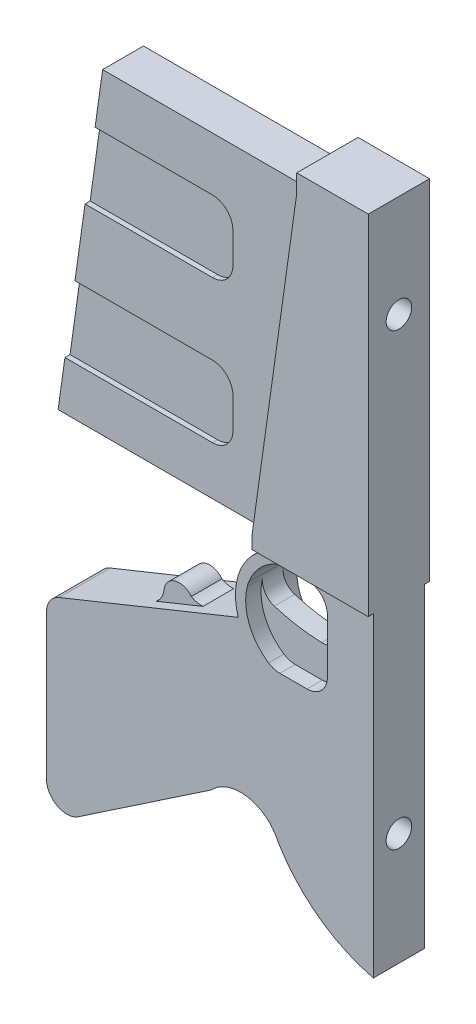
ISO-10303-21;
HEADER;
FILE_DESCRIPTION(('STEP AP214'),'2;1');
FILE_NAME('part.step','',(''),(''),'','','');
FILE_SCHEMA(('AUTOMOTIVE_DESIGN { 1 0 10303 214 1 1 1 1 }'));
ENDSEC;
DATA;
#1=APPLICATION_CONTEXT('core data for automotive mechanical design processes');
#2=APPLICATION_PROTOCOL_DEFINITION('international standard','automotive_design',2000,#1);
#3=PRODUCT_CONTEXT('',#1,'mechanical');
#4=PRODUCT('Part','Part','',(#3));
#5=PRODUCT_RELATED_PRODUCT_CATEGORY('part','',(#4));
#6=PRODUCT_DEFINITION_FORMATION('','',#4);
#7=PRODUCT_DEFINITION_CONTEXT('part definition',#1,'design');
#8=PRODUCT_DEFINITION('design','',#6,#7);
#9=PRODUCT_DEFINITION_SHAPE('','',#8);
#10=(LENGTH_UNIT() NAMED_UNIT(*) SI_UNIT(.MILLI.,.METRE.));
#11=(NAMED_UNIT(*) PLANE_ANGLE_UNIT() SI_UNIT($,.RADIAN.));
#12=(NAMED_UNIT(*) SI_UNIT($,.STERADIAN.) SOLID_ANGLE_UNIT());
#13=UNCERTAINTY_MEASURE_WITH_UNIT(LENGTH_MEASURE(1.E-05),#10,'distance_accuracy_value','');
#14=(GEOMETRIC_REPRESENTATION_CONTEXT(3) GLOBAL_UNCERTAINTY_ASSIGNED_CONTEXT((#13)) GLOBAL_UNIT_ASSIGNED_CONTEXT((#10,
#11,#12)) REPRESENTATION_CONTEXT('',''));
#15=CARTESIAN_POINT('',(0.,0.,0.));
#16=DIRECTION('',(0.,0.,1.));
#17=DIRECTION('',(1.,0.,0.));
#18=AXIS2_PLACEMENT_3D('',#15,#16,#17);
#19=CARTESIAN_POINT('',(0.,88.,4.));
#20=DIRECTION('',(0.,1.,0.));
#21=DIRECTION('',(0.,0.,1.));
#22=AXIS2_PLACEMENT_3D('',#19,#20,#21);
#23=PLANE('',#22);
#24=DIRECTION('',(1.,0.,0.));
#25=VECTOR('',#24,1.);
#26=CARTESIAN_POINT('',(0.,88.,-3.));
#27=LINE('',#26,#25);
#28=CARTESIAN_POINT('',(-59.4108221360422,88.,-3.));
#29=VERTEX_POINT('',#28);
#30=CARTESIAN_POINT('',(-32.5000000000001,88.,-3.));
#31=VERTEX_POINT('',#30);
#32=EDGE_CURVE('E509',#29,#31,#27,.T.);
#33=ORIENTED_EDGE('',*,*,#32,.F.);
#34=DIRECTION('',(0.,0.,-1.));
#35=VECTOR('',#34,1.);
#36=CARTESIAN_POINT('',(-59.4108221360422,88.,4.));
#37=LINE('',#36,#35);
#38=CARTESIAN_POINT('',(-59.4108221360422,88.,-4.));
#39=VERTEX_POINT('',#38);
#40=EDGE_CURVE('E655',#29,#39,#37,.T.);
#41=ORIENTED_EDGE('',*,*,#40,.T.);
#42=DIRECTION('',(1.,0.,0.));
#43=VECTOR('',#42,1.);
#44=CARTESIAN_POINT('',(0.,88.,-4.));
#45=LINE('',#44,#43);
#46=CARTESIAN_POINT('',(-32.5000000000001,88.,-4.));
#47=VERTEX_POINT('',#46);
#48=EDGE_CURVE('E597',#39,#47,#45,.T.);
#49=ORIENTED_EDGE('',*,*,#48,.T.);
#50=DIRECTION('',(0.,0.,-1.));
#51=VECTOR('',#50,1.);
#52=CARTESIAN_POINT('',(-32.5000000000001,88.,4.));
#53=LINE('',#52,#51);
#54=EDGE_CURVE('E651',#31,#47,#53,.T.);
#55=ORIENTED_EDGE('',*,*,#54,.F.);
#56=EDGE_LOOP('',(#33,#41,#49,#55));
#57=FACE_BOUND('',#56,.T.);
#58=ADVANCED_FACE('F42',(#57),#23,.F.);
#59=CARTESIAN_POINT('',(-32.5,84.,4.));
#60=DIRECTION('',(0.,0.,-1.));
#61=DIRECTION('',(-1.,0.,0.));
#62=AXIS2_PLACEMENT_3D('',#59,#60,#61);
#63=CYLINDRICAL_SURFACE('',#62,4.);
#64=CARTESIAN_POINT('',(-32.5,84.,-3.));
#65=DIRECTION('',(0.,0.,1.));
#66=DIRECTION('',(1.,0.,0.));
#67=AXIS2_PLACEMENT_3D('',#64,#65,#66);
#68=CIRCLE('',#67,4.);
#69=CARTESIAN_POINT('',(-28.5,84.,-3.));
#70=VERTEX_POINT('',#69);
#71=EDGE_CURVE('E489',#31,#70,#68,.F.);
#72=ORIENTED_EDGE('',*,*,#71,.F.);
#73=ORIENTED_EDGE('',*,*,#54,.T.);
#74=CARTESIAN_POINT('',(-32.5,84.,-4.));
#75=DIRECTION('',(0.,0.,1.));
#76=DIRECTION('',(1.,0.,0.));
#77=AXIS2_PLACEMENT_3D('',#74,#75,#76);
#78=CIRCLE('',#77,4.);
#79=CARTESIAN_POINT('',(-28.5,84.,-4.));
#80=VERTEX_POINT('',#79);
#81=EDGE_CURVE('E601',#47,#80,#78,.F.);
#82=ORIENTED_EDGE('',*,*,#81,.T.);
#83=DIRECTION('',(0.,0.,-1.));
#84=VECTOR('',#83,1.);
#85=CARTESIAN_POINT('',(-28.5,84.,4.));
#86=LINE('',#85,#84);
#87=EDGE_CURVE('E647',#70,#80,#86,.T.);
#88=ORIENTED_EDGE('',*,*,#87,.F.);
#89=EDGE_LOOP('',(#72,#73,#82,#88));
#90=FACE_BOUND('',#89,.T.);
#91=ADVANCED_FACE('F1061',(#90),#63,.F.);
#92=CARTESIAN_POINT('',(-28.5,0.,4.));
#93=DIRECTION('',(1.,0.,0.));
#94=DIRECTION('',(0.,1.,0.));
#95=AXIS2_PLACEMENT_3D('',#92,#93,#94);
#96=PLANE('',#95);
#97=DIRECTION('',(0.,-1.,0.));
#98=VECTOR('',#97,1.);
#99=CARTESIAN_POINT('',(-28.5,0.,-3.));
#100=LINE('',#99,#98);
#101=CARTESIAN_POINT('',(-28.5,78.,-3.));
#102=VERTEX_POINT('',#101);
#103=EDGE_CURVE('E494',#70,#102,#100,.T.);
#104=ORIENTED_EDGE('',*,*,#103,.F.);
#105=ORIENTED_EDGE('',*,*,#87,.T.);
#106=DIRECTION('',(0.,-1.,0.));
#107=VECTOR('',#106,1.);
#108=CARTESIAN_POINT('',(-28.5,0.,-4.));
#109=LINE('',#108,#107);
#110=CARTESIAN_POINT('',(-28.5,78.,-4.));
#111=VERTEX_POINT('',#110);
#112=EDGE_CURVE('E604',#80,#111,#109,.T.);
#113=ORIENTED_EDGE('',*,*,#112,.T.);
#114=DIRECTION('',(0.,0.,-1.));
#115=VECTOR('',#114,1.);
#116=CARTESIAN_POINT('',(-28.5,78.,4.));
#117=LINE('',#116,#115);
#118=EDGE_CURVE('E643',#102,#111,#117,.T.);
#119=ORIENTED_EDGE('',*,*,#118,.F.);
#120=EDGE_LOOP('',(#104,#105,#113,#119));
#121=FACE_BOUND('',#120,.T.);
#122=ADVANCED_FACE('F1068',(#121),#96,.F.);
#123=CARTESIAN_POINT('',(-32.5,78.,4.));
#124=DIRECTION('',(0.,0.,-1.));
#125=DIRECTION('',(-1.,0.,0.));
#126=AXIS2_PLACEMENT_3D('',#123,#124,#125);
#127=CYLINDRICAL_SURFACE('',#126,4.);
#128=CARTESIAN_POINT('',(-32.5,78.,-3.));
#129=DIRECTION('',(0.,0.,1.));
#130=DIRECTION('',(1.,0.,0.));
#131=AXIS2_PLACEMENT_3D('',#128,#129,#130);
#132=CIRCLE('',#131,4.);
#133=CARTESIAN_POINT('',(-32.5,74.,-3.));
#134=VERTEX_POINT('',#133);
#135=EDGE_CURVE('E514',#102,#134,#132,.F.);
#136=ORIENTED_EDGE('',*,*,#135,.F.);
#137=ORIENTED_EDGE('',*,*,#118,.T.);
#138=CARTESIAN_POINT('',(-32.5,78.,-4.));
#139=DIRECTION('',(0.,0.,1.));
#140=DIRECTION('',(1.,0.,0.));
#141=AXIS2_PLACEMENT_3D('',#138,#139,#140);
#142=CIRCLE('',#141,4.);
#143=CARTESIAN_POINT('',(-32.5,74.,-4.));
#144=VERTEX_POINT('',#143);
#145=EDGE_CURVE('E607',#111,#144,#142,.F.);
#146=ORIENTED_EDGE('',*,*,#145,.T.);
#147=DIRECTION('',(0.,0.,-1.));
#148=VECTOR('',#147,1.);
#149=CARTESIAN_POINT('',(-32.5,74.,4.));
#150=LINE('',#149,#148);
#151=EDGE_CURVE('E639',#134,#144,#150,.T.);
#152=ORIENTED_EDGE('',*,*,#151,.F.);
#153=EDGE_LOOP('',(#136,#137,#146,#152));
#154=FACE_BOUND('',#153,.T.);
#155=ADVANCED_FACE('F1226',(#154),#127,.F.);
#156=CARTESIAN_POINT('',(0.,74.,4.));
#157=DIRECTION('',(0.,-1.,0.));
#158=DIRECTION('',(1.,0.,0.));
#159=AXIS2_PLACEMENT_3D('',#156,#157,#158);
#160=PLANE('',#159);
#161=DIRECTION('',(-1.,0.,0.));
#162=VECTOR('',#161,1.);
#163=CARTESIAN_POINT('',(0.,74.,-3.));
#164=LINE('',#163,#162);
#165=CARTESIAN_POINT('',(-61.3783938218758,74.,-3.));
#166=VERTEX_POINT('',#165);
#167=EDGE_CURVE('E59',#134,#166,#164,.T.);
#168=ORIENTED_EDGE('',*,*,#167,.F.);
#169=ORIENTED_EDGE('',*,*,#151,.T.);
#170=DIRECTION('',(-1.,0.,0.));
#171=VECTOR('',#170,1.);
#172=CARTESIAN_POINT('',(0.,74.,-4.));
#173=LINE('',#172,#171);
#174=CARTESIAN_POINT('',(-61.3783938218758,74.,-4.));
#175=VERTEX_POINT('',#174);
#176=EDGE_CURVE('E610',#144,#175,#173,.T.);
#177=ORIENTED_EDGE('',*,*,#176,.T.);
#178=DIRECTION('',(0.,0.,-1.));
#179=VECTOR('',#178,1.);
#180=CARTESIAN_POINT('',(-61.3783938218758,74.,4.));
#181=LINE('',#180,#179);
#182=EDGE_CURVE('E635',#166,#175,#181,.T.);
#183=ORIENTED_EDGE('',*,*,#182,.F.);
#184=EDGE_LOOP('',(#168,#169,#177,#183));
#185=FACE_BOUND('',#184,.T.);
#186=ADVANCED_FACE('F1229',(#185),#160,.F.);
#187=CARTESIAN_POINT('',(0.,116.,4.));
#188=DIRECTION('',(0.,1.,0.));
#189=DIRECTION('',(0.,0.,1.));
#190=AXIS2_PLACEMENT_3D('',#187,#188,#189);
#191=PLANE('',#190);
#192=DIRECTION('',(1.,0.,0.));
#193=VECTOR('',#192,1.);
#194=CARTESIAN_POINT('',(0.,116.,-3.));
#195=LINE('',#194,#193);
#196=CARTESIAN_POINT('',(-55.4756787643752,116.,-3.));
#197=VERTEX_POINT('',#196);
#198=CARTESIAN_POINT('',(-32.5000000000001,116.,-3.));
#199=VERTEX_POINT('',#198);
#200=EDGE_CURVE('E533',#197,#199,#195,.T.);
#201=ORIENTED_EDGE('',*,*,#200,.F.);
#202=DIRECTION('',(0.,0.,-1.));
#203=VECTOR('',#202,1.);
#204=CARTESIAN_POINT('',(-55.4756787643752,116.,4.));
#205=LINE('',#204,#203);
#206=CARTESIAN_POINT('',(-55.4756787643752,116.,-4.));
#207=VERTEX_POINT('',#206);
#208=EDGE_CURVE('E624',#197,#207,#205,.T.);
#209=ORIENTED_EDGE('',*,*,#208,.T.);
#210=DIRECTION('',(1.,0.,0.));
#211=VECTOR('',#210,1.);
#212=CARTESIAN_POINT('',(0.,116.,-4.));
#213=LINE('',#212,#211);
#214=CARTESIAN_POINT('',(-32.5000000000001,116.,-4.));
#215=VERTEX_POINT('',#214);
#216=EDGE_CURVE('E531',#207,#215,#213,.T.);
#217=ORIENTED_EDGE('',*,*,#216,.T.);
#218=DIRECTION('',(0.,0.,-1.));
#219=VECTOR('',#218,1.);
#220=CARTESIAN_POINT('',(-32.5000000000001,116.,4.));
#221=LINE('',#220,#219);
#222=EDGE_CURVE('E675',#199,#215,#221,.T.);
#223=ORIENTED_EDGE('',*,*,#222,.F.);
#224=EDGE_LOOP('',(#201,#209,#217,#223));
#225=FACE_BOUND('',#224,.T.);
#226=ADVANCED_FACE('F1197',(#225),#191,.F.);
#227=CARTESIAN_POINT('',(-32.5,112.,4.));
#228=DIRECTION('',(0.,0.,-1.));
#229=DIRECTION('',(-1.,0.,0.));
#230=AXIS2_PLACEMENT_3D('',#227,#228,#229);
#231=CYLINDRICAL_SURFACE('',#230,4.);
#232=CARTESIAN_POINT('',(-32.5,112.,-3.));
#233=DIRECTION('',(0.,0.,1.));
#234=DIRECTION('',(1.,0.,0.));
#235=AXIS2_PLACEMENT_3D('',#232,#233,#234);
#236=CIRCLE('',#235,4.);
#237=CARTESIAN_POINT('',(-28.5,112.,-3.));
#238=VERTEX_POINT('',#237);
#239=EDGE_CURVE('E67',#199,#238,#236,.F.);
#240=ORIENTED_EDGE('',*,*,#239,.F.);
#241=ORIENTED_EDGE('',*,*,#222,.T.);
#242=CARTESIAN_POINT('',(-32.5,112.,-4.));
#243=DIRECTION('',(0.,0.,1.));
#244=DIRECTION('',(1.,0.,0.));
#245=AXIS2_PLACEMENT_3D('',#242,#243,#244);
#246=CIRCLE('',#245,4.);
#247=CARTESIAN_POINT('',(-28.5,112.,-4.));
#248=VERTEX_POINT('',#247);
#249=EDGE_CURVE('E582',#215,#248,#246,.F.);
#250=ORIENTED_EDGE('',*,*,#249,.T.);
#251=DIRECTION('',(0.,0.,-1.));
#252=VECTOR('',#251,1.);
#253=CARTESIAN_POINT('',(-28.5,112.,4.));
#254=LINE('',#253,#252);
#255=EDGE_CURVE('E671',#238,#248,#254,.T.);
#256=ORIENTED_EDGE('',*,*,#255,.F.);
#257=EDGE_LOOP('',(#240,#241,#250,#256));
#258=FACE_BOUND('',#257,.T.);
#259=ADVANCED_FACE('F1237',(#258),#231,.F.);
#260=CARTESIAN_POINT('',(-28.5000000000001,0.,4.));
#261=DIRECTION('',(1.,0.,0.));
#262=DIRECTION('',(0.,1.,0.));
#263=AXIS2_PLACEMENT_3D('',#260,#261,#262);
#264=PLANE('',#263);
#265=DIRECTION('',(0.,-1.,0.));
#266=VECTOR('',#265,1.);
#267=CARTESIAN_POINT('',(-28.5000000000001,0.,-3.));
#268=LINE('',#267,#266);
#269=CARTESIAN_POINT('',(-28.5,106.,-3.));
#270=VERTEX_POINT('',#269);
#271=EDGE_CURVE('E520',#238,#270,#268,.T.);
#272=ORIENTED_EDGE('',*,*,#271,.F.);
#273=ORIENTED_EDGE('',*,*,#255,.T.);
#274=DIRECTION('',(0.,-1.,0.));
#275=VECTOR('',#274,1.);
#276=CARTESIAN_POINT('',(-28.5000000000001,0.,-4.));
#277=LINE('',#276,#275);
#278=CARTESIAN_POINT('',(-28.5,106.,-4.));
#279=VERTEX_POINT('',#278);
#280=EDGE_CURVE('E585',#248,#279,#277,.T.);
#281=ORIENTED_EDGE('',*,*,#280,.T.);
#282=DIRECTION('',(0.,0.,-1.));
#283=VECTOR('',#282,1.);
#284=CARTESIAN_POINT('',(-28.5,106.,4.));
#285=LINE('',#284,#283);
#286=EDGE_CURVE('E667',#270,#279,#285,.T.);
#287=ORIENTED_EDGE('',*,*,#286,.F.);
#288=EDGE_LOOP('',(#272,#273,#281,#287));
#289=FACE_BOUND('',#288,.T.);
#290=ADVANCED_FACE('F1284',(#289),#264,.F.);
#291=CARTESIAN_POINT('',(-32.5,106.,4.));
#292=DIRECTION('',(0.,0.,-1.));
#293=DIRECTION('',(-1.,0.,0.));
#294=AXIS2_PLACEMENT_3D('',#291,#292,#293);
#295=CYLINDRICAL_SURFACE('',#294,4.);
#296=CARTESIAN_POINT('',(-32.5,106.,-3.));
#297=DIRECTION('',(0.,0.,1.));
#298=DIRECTION('',(1.,0.,0.));
#299=AXIS2_PLACEMENT_3D('',#296,#297,#298);
#300=CIRCLE('',#299,4.);
#301=CARTESIAN_POINT('',(-32.5000000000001,102.,-3.));
#302=VERTEX_POINT('',#301);
#303=EDGE_CURVE('E542',#270,#302,#300,.F.);
#304=ORIENTED_EDGE('',*,*,#303,.F.);
#305=ORIENTED_EDGE('',*,*,#286,.T.);
#306=CARTESIAN_POINT('',(-32.5,106.,-4.));
#307=DIRECTION('',(0.,0.,1.));
#308=DIRECTION('',(1.,0.,0.));
#309=AXIS2_PLACEMENT_3D('',#306,#307,#308);
#310=CIRCLE('',#309,4.);
#311=CARTESIAN_POINT('',(-32.5000000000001,102.,-4.));
#312=VERTEX_POINT('',#311);
#313=EDGE_CURVE('E588',#279,#312,#310,.F.);
#314=ORIENTED_EDGE('',*,*,#313,.T.);
#315=DIRECTION('',(0.,0.,-1.));
#316=VECTOR('',#315,1.);
#317=CARTESIAN_POINT('',(-32.5000000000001,102.,4.));
#318=LINE('',#317,#316);
#319=EDGE_CURVE('E663',#302,#312,#318,.T.);
#320=ORIENTED_EDGE('',*,*,#319,.F.);
#321=EDGE_LOOP('',(#304,#305,#314,#320));
#322=FACE_BOUND('',#321,.T.);
#323=ADVANCED_FACE('F1205',(#322),#295,.F.);
#324=CARTESIAN_POINT('',(0.,102.,4.));
#325=DIRECTION('',(0.,-1.,0.));
#326=DIRECTION('',(1.,0.,0.));
#327=AXIS2_PLACEMENT_3D('',#324,#325,#326);
#328=PLANE('',#327);
#329=DIRECTION('',(-1.,0.,0.));
#330=VECTOR('',#329,1.);
#331=CARTESIAN_POINT('',(0.,102.,-3.));
#332=LINE('',#331,#330);
#333=CARTESIAN_POINT('',(-57.4432504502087,102.,-3.));
#334=VERTEX_POINT('',#333);
#335=EDGE_CURVE('E539',#302,#334,#332,.T.);
#336=ORIENTED_EDGE('',*,*,#335,.F.);
#337=ORIENTED_EDGE('',*,*,#319,.T.);
#338=DIRECTION('',(-1.,0.,0.));
#339=VECTOR('',#338,1.);
#340=CARTESIAN_POINT('',(0.,102.,-4.));
#341=LINE('',#340,#339);
#342=CARTESIAN_POINT('',(-57.4432504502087,102.,-4.));
#343=VERTEX_POINT('',#342);
#344=EDGE_CURVE('E591',#312,#343,#341,.T.);
#345=ORIENTED_EDGE('',*,*,#344,.T.);
#346=DIRECTION('',(0.,0.,-1.));
#347=VECTOR('',#346,1.);
#348=CARTESIAN_POINT('',(-57.4432504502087,102.,4.));
#349=LINE('',#348,#347);
#350=EDGE_CURVE('E659',#334,#343,#349,.T.);
#351=ORIENTED_EDGE('',*,*,#350,.F.);
#352=EDGE_LOOP('',(#336,#337,#345,#351));
#353=FACE_BOUND('',#352,.T.);
#354=ADVANCED_FACE('F1203',(#353),#328,.F.);
#355=CARTESIAN_POINT('',(-31.162894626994,4.37965922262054,6.));
#356=DIRECTION('',(0.99026806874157,-0.13917310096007,0.));
#357=DIRECTION('',(0.13917310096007,0.99026806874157,0.));
#358=AXIS2_PLACEMENT_3D('',#355,#356,#357);
#359=PLANE('',#358);
#360=DIRECTION('',(-0.13917310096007,-0.99026806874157,0.));
#361=VECTOR('',#360,1.);
#362=CARTESIAN_POINT('',(-31.162894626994,4.37965922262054,-4.));
#363=LINE('',#362,#361);
#364=CARTESIAN_POINT('',(-14.,126.5,-4.));
#365=VERTEX_POINT('',#364);
#366=CARTESIAN_POINT('',(-22.7135317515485,64.5,-4.));
#367=VERTEX_POINT('',#366);
#368=EDGE_CURVE('E616',#365,#367,#363,.T.);
#369=ORIENTED_EDGE('',*,*,#368,.F.);
#370=DIRECTION('',(0.,0.,-1.));
#371=VECTOR('',#370,1.);
#372=CARTESIAN_POINT('',(-14.,126.5,6.));
#373=LINE('',#372,#371);
#374=CARTESIAN_POINT('',(-14.,126.5,-6.));
#375=VERTEX_POINT('',#374);
#376=EDGE_CURVE('E791',#365,#375,#373,.T.);
#377=ORIENTED_EDGE('',*,*,#376,.T.);
#378=DIRECTION('',(-0.13917310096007,-0.99026806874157,0.));
#379=VECTOR('',#378,1.);
#380=CARTESIAN_POINT('',(-31.162894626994,4.37965922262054,-6.));
#381=LINE('',#380,#379);
#382=CARTESIAN_POINT('',(-22.7135317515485,64.5,-6.));
#383=VERTEX_POINT('',#382);
#384=EDGE_CURVE('E763',#375,#383,#381,.T.);
#385=ORIENTED_EDGE('',*,*,#384,.T.);
#386=DIRECTION('',(0.,0.,-1.));
#387=VECTOR('',#386,1.);
#388=CARTESIAN_POINT('',(-22.7135317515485,64.5,6.));
#389=LINE('',#388,#387);
#390=EDGE_CURVE('E773',#367,#383,#389,.T.);
#391=ORIENTED_EDGE('',*,*,#390,.F.);
#392=EDGE_LOOP('',(#369,#377,#385,#391));
#393=FACE_BOUND('',#392,.T.);
#394=ADVANCED_FACE('F1144',(#393),#359,.F.);
#395=CARTESIAN_POINT('',(-15.,51.5,5.));
#396=DIRECTION('',(0.,0.,-1.));
#397=DIRECTION('',(-1.,0.,0.));
#398=AXIS2_PLACEMENT_3D('',#395,#396,#397);
#399=CYLINDRICAL_SURFACE('',#398,10.);
#400=CARTESIAN_POINT('',(-15.,51.5,-2.));
#401=DIRECTION('',(0.,0.,1.));
#402=DIRECTION('',(1.,0.,0.));
#403=AXIS2_PLACEMENT_3D('',#400,#401,#402);
#404=CIRCLE('',#403,10.);
#405=CARTESIAN_POINT('',(-20.5277079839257,43.1666666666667,-2.));
#406=VERTEX_POINT('',#405);
#407=CARTESIAN_POINT('',(-24.6792539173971,54.0123780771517,-2.));
#408=VERTEX_POINT('',#407);
#409=EDGE_CURVE('E710',#406,#408,#404,.F.);
#410=ORIENTED_EDGE('',*,*,#409,.F.);
#411=DIRECTION('',(0.,0.,-1.));
#412=VECTOR('',#411,1.);
#413=CARTESIAN_POINT('',(-20.5277079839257,43.1666666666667,5.));
#414=LINE('',#413,#412);
#415=CARTESIAN_POINT('',(-20.5277079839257,43.1666666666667,-5.));
#416=VERTEX_POINT('',#415);
#417=EDGE_CURVE('E922',#406,#416,#414,.T.);
#418=ORIENTED_EDGE('',*,*,#417,.T.);
#419=CARTESIAN_POINT('',(-15.,51.5,-5.));
#420=DIRECTION('',(0.,0.,1.));
#421=DIRECTION('',(1.,0.,0.));
#422=AXIS2_PLACEMENT_3D('',#419,#420,#421);
#423=CIRCLE('',#422,10.);
#424=CARTESIAN_POINT('',(-24.6792539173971,54.0123780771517,-5.));
#425=VERTEX_POINT('',#424);
#426=EDGE_CURVE('E895',#416,#425,#423,.F.);
#427=ORIENTED_EDGE('',*,*,#426,.T.);
#428=DIRECTION('',(0.,0.,-1.));
#429=VECTOR('',#428,1.);
#430=CARTESIAN_POINT('',(-24.6792539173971,54.0123780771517,5.));
#431=LINE('',#430,#429);
#432=EDGE_CURVE('E51',#408,#425,#431,.T.);
#433=ORIENTED_EDGE('',*,*,#432,.F.);
#434=EDGE_LOOP('',(#410,#418,#427,#433));
#435=FACE_BOUND('',#434,.T.);
#436=ADVANCED_FACE('F971',(#435),#399,.F.);
#437=CARTESIAN_POINT('',(-13.,46.5,5.));
#438=DIRECTION('',(0.,0.,-1.));
#439=DIRECTION('',(-1.,0.,0.));
#440=AXIS2_PLACEMENT_3D('',#437,#438,#439);
#441=CYLINDRICAL_SURFACE('',#440,4.);
#442=CARTESIAN_POINT('',(-13.,46.5,-2.));
#443=DIRECTION('',(0.,0.,1.));
#444=DIRECTION('',(1.,0.,0.));
#445=AXIS2_PLACEMENT_3D('',#442,#443,#444);
#446=CIRCLE('',#445,4.);
#447=CARTESIAN_POINT('',(-9.,46.5,-2.));
#448=VERTEX_POINT('',#447);
#449=CARTESIAN_POINT('',(-13.,42.5,-2.));
#450=VERTEX_POINT('',#449);
#451=EDGE_CURVE('E718',#448,#450,#446,.F.);
#452=ORIENTED_EDGE('',*,*,#451,.F.);
#453=DIRECTION('',(0.,0.,-1.));
#454=VECTOR('',#453,1.);
#455=CARTESIAN_POINT('',(-9.,46.5,5.));
#456=LINE('',#455,#454);
#457=CARTESIAN_POINT('',(-9.,46.5,-5.));
#458=VERTEX_POINT('',#457);
#459=EDGE_CURVE('E930',#448,#458,#456,.T.);
#460=ORIENTED_EDGE('',*,*,#459,.T.);
#461=CARTESIAN_POINT('',(-13.,46.5,-5.));
#462=DIRECTION('',(0.,0.,1.));
#463=DIRECTION('',(1.,0.,0.));
#464=AXIS2_PLACEMENT_3D('',#461,#462,#463);
#465=CIRCLE('',#464,4.);
#466=CARTESIAN_POINT('',(-13.,42.5,-5.));
#467=VERTEX_POINT('',#466);
#468=EDGE_CURVE('E910',#458,#467,#465,.F.);
#469=ORIENTED_EDGE('',*,*,#468,.T.);
#470=DIRECTION('',(0.,0.,-1.));
#471=VECTOR('',#470,1.);
#472=CARTESIAN_POINT('',(-13.,42.5,5.));
#473=LINE('',#472,#471);
#474=EDGE_CURVE('E926',#450,#467,#473,.T.);
#475=ORIENTED_EDGE('',*,*,#474,.F.);
#476=EDGE_LOOP('',(#452,#460,#469,#475));
#477=FACE_BOUND('',#476,.T.);
#478=ADVANCED_FACE('F991',(#477),#441,.F.);
#479=CARTESIAN_POINT('',(0.,42.5,5.));
#480=DIRECTION('',(0.,-1.,0.));
#481=DIRECTION('',(0.,0.,-1.));
#482=AXIS2_PLACEMENT_3D('',#479,#480,#481);
#483=PLANE('',#482);
#484=DIRECTION('',(-1.,0.,0.));
#485=VECTOR('',#484,1.);
#486=CARTESIAN_POINT('',(0.,42.5,-2.));
#487=LINE('',#486,#485);
#488=CARTESIAN_POINT('',(-18.3166247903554,42.5,-2.));
#489=VERTEX_POINT('',#488);
#490=EDGE_CURVE('E716',#450,#489,#487,.T.);
#491=ORIENTED_EDGE('',*,*,#490,.F.);
#492=ORIENTED_EDGE('',*,*,#474,.T.);
#493=DIRECTION('',(-1.,0.,0.));
#494=VECTOR('',#493,1.);
#495=CARTESIAN_POINT('',(0.,42.5,-5.));
#496=LINE('',#495,#494);
#497=CARTESIAN_POINT('',(-18.3166247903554,42.5,-5.));
#498=VERTEX_POINT('',#497);
#499=EDGE_CURVE('E913',#467,#498,#496,.T.);
#500=ORIENTED_EDGE('',*,*,#499,.T.);
#501=DIRECTION('',(0.,0.,-1.));
#502=VECTOR('',#501,1.);
#503=CARTESIAN_POINT('',(-18.3166247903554,42.5,5.));
#504=LINE('',#503,#502);
#505=EDGE_CURVE('E921',#489,#498,#504,.T.);
#506=ORIENTED_EDGE('',*,*,#505,.F.);
#507=EDGE_LOOP('',(#491,#492,#500,#506));
#508=FACE_BOUND('',#507,.T.);
#509=ADVANCED_FACE('F984',(#508),#483,.F.);
#510=CARTESIAN_POINT('',(-18.3166247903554,46.5,5.));
#511=DIRECTION('',(0.,0.,-1.));
#512=DIRECTION('',(-1.,0.,0.));
#513=AXIS2_PLACEMENT_3D('',#510,#511,#512);
#514=CYLINDRICAL_SURFACE('',#513,4.);
#515=ORIENTED_EDGE('',*,*,#417,.F.);
#516=CARTESIAN_POINT('',(-18.3166247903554,46.5,-2.));
#517=DIRECTION('',(0.,0.,1.));
#518=DIRECTION('',(1.,0.,0.));
#519=AXIS2_PLACEMENT_3D('',#516,#517,#518);
#520=CIRCLE('',#519,4.);
#521=EDGE_CURVE('E713',#406,#489,#520,.T.);
#522=ORIENTED_EDGE('',*,*,#521,.T.);
#523=ORIENTED_EDGE('',*,*,#505,.T.);
#524=CARTESIAN_POINT('',(-18.3166247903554,46.5,-5.));
#525=DIRECTION('',(0.,0.,1.));
#526=DIRECTION('',(1.,0.,0.));
#527=AXIS2_PLACEMENT_3D('',#524,#525,#526);
#528=CIRCLE('',#527,4.);
#529=EDGE_CURVE('E814',#416,#498,#528,.T.);
#530=ORIENTED_EDGE('',*,*,#529,.F.);
#531=EDGE_LOOP('',(#515,#522,#523,#530));
#532=FACE_BOUND('',#531,.T.);
#533=ADVANCED_FACE('F980',(#532),#514,.F.);
#534=CARTESIAN_POINT('',(-20.5277079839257,43.1666666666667,5.));
#535=VERTEX_POINT('',#534);
#536=CARTESIAN_POINT('',(-20.5277079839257,43.1666666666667,2.));
#537=VERTEX_POINT('',#536);
#538=EDGE_CURVE('E918',#535,#537,#414,.T.);
#539=ORIENTED_EDGE('',*,*,#538,.T.);
#540=CARTESIAN_POINT('',(-15.,51.5,2.));
#541=DIRECTION('',(0.,0.,1.));
#542=DIRECTION('',(1.,0.,0.));
#543=AXIS2_PLACEMENT_3D('',#540,#541,#542);
#544=CIRCLE('',#543,10.);
#545=CARTESIAN_POINT('',(-24.6792539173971,54.0123780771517,2.));
#546=VERTEX_POINT('',#545);
#547=EDGE_CURVE('E688',#537,#546,#544,.F.);
#548=ORIENTED_EDGE('',*,*,#547,.T.);
#549=CARTESIAN_POINT('',(-24.6792539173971,54.0123780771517,5.));
#550=VERTEX_POINT('',#549);
#551=EDGE_CURVE('E11',#550,#546,#431,.T.);
#552=ORIENTED_EDGE('',*,*,#551,.F.);
#553=CARTESIAN_POINT('',(-15.,51.5,5.));
#554=DIRECTION('',(0.,0.,1.));
#555=DIRECTION('',(1.,0.,0.));
#556=AXIS2_PLACEMENT_3D('',#553,#554,#555);
#557=CIRCLE('',#556,10.);
#558=EDGE_CURVE('E842',#535,#550,#557,.F.);
#559=ORIENTED_EDGE('',*,*,#558,.F.);
#560=EDGE_LOOP('',(#539,#548,#552,#559));
#561=FACE_BOUND('',#560,.T.);
#562=ADVANCED_FACE('F1047',(#561),#399,.F.);
#563=CARTESIAN_POINT('',(-21.4251551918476,53.4970231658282,5.));
#564=DIRECTION('',(0.,0.,-1.));
#565=DIRECTION('',(-1.,0.,0.));
#566=AXIS2_PLACEMENT_3D('',#563,#564,#565);
#567=CYLINDRICAL_SURFACE('',#566,3.29465464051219);
#568=CARTESIAN_POINT('',(-21.4251551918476,53.4970231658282,-5.));
#569=DIRECTION('',(0.,0.,1.));
#570=DIRECTION('',(1.,0.,0.));
#571=AXIS2_PLACEMENT_3D('',#568,#569,#570);
#572=CIRCLE('',#571,3.29465464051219);
#573=CARTESIAN_POINT('',(-24.3980539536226,54.9171013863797,-5.));
#574=VERTEX_POINT('',#573);
#575=EDGE_CURVE('E898',#425,#574,#572,.F.);
#576=ORIENTED_EDGE('',*,*,#575,.T.);
#577=DIRECTION('',(0.,0.,-1.));
#578=VECTOR('',#577,1.);
#579=CARTESIAN_POINT('',(-24.3980539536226,54.9171013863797,5.));
#580=LINE('',#579,#578);
#581=CARTESIAN_POINT('',(-24.3980539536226,54.9171013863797,5.));
#582=VERTEX_POINT('',#581);
#583=EDGE_CURVE('E946',#582,#574,#580,.T.);
#584=ORIENTED_EDGE('',*,*,#583,.F.);
#585=CARTESIAN_POINT('',(-21.4251551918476,53.4970231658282,5.));
#586=DIRECTION('',(0.,0.,1.));
#587=DIRECTION('',(1.,0.,0.));
#588=AXIS2_PLACEMENT_3D('',#585,#586,#587);
#589=CIRCLE('',#588,3.29465464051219);
#590=EDGE_CURVE('E845',#550,#582,#589,.F.);
#591=ORIENTED_EDGE('',*,*,#590,.F.);
#592=ORIENTED_EDGE('',*,*,#551,.T.);
#593=CARTESIAN_POINT('',(-21.4251551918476,53.4970231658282,2.));
#594=DIRECTION('',(0.,0.,1.));
#595=DIRECTION('',(1.,0.,0.));
#596=AXIS2_PLACEMENT_3D('',#593,#594,#595);
#597=CIRCLE('',#596,3.29465464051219);
#598=CARTESIAN_POINT('',(-22.3941768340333,50.348095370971,2.));
#599=VERTEX_POINT('',#598);
#600=EDGE_CURVE('E686',#599,#546,#597,.F.);
#601=ORIENTED_EDGE('',*,*,#600,.F.);
#602=DIRECTION('',(0.,0.,-1.));
#603=VECTOR('',#602,1.);
#604=CARTESIAN_POINT('',(-22.3941768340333,50.348095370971,2.));
#605=LINE('',#604,#603);
#606=CARTESIAN_POINT('',(-22.3941768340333,50.348095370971,-2.));
#607=VERTEX_POINT('',#606);
#608=EDGE_CURVE('E722',#599,#607,#605,.T.);
#609=ORIENTED_EDGE('',*,*,#608,.T.);
#610=CARTESIAN_POINT('',(-21.4251551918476,53.4970231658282,-2.));
#611=DIRECTION('',(0.,0.,1.));
#612=DIRECTION('',(1.,0.,0.));
#613=AXIS2_PLACEMENT_3D('',#610,#611,#612);
#614=CIRCLE('',#613,3.29465464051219);
#615=EDGE_CURVE('E708',#607,#408,#614,.F.);
#616=ORIENTED_EDGE('',*,*,#615,.T.);
#617=ORIENTED_EDGE('',*,*,#432,.T.);
#618=EDGE_LOOP('',(#576,#584,#591,#592,#601,#609,#616,#617));
#619=FACE_BOUND('',#618,.T.);
#620=ADVANCED_FACE('F1019',(#619),#567,.F.);
#621=CARTESIAN_POINT('',(-18.9965262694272,60.6666666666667,-5.));
#622=VERTEX_POINT('',#621);
#623=EDGE_CURVE('E899',#574,#622,#423,.F.);
#624=ORIENTED_EDGE('',*,*,#623,.T.);
#625=DIRECTION('',(0.,0.,-1.));
#626=VECTOR('',#625,1.);
#627=CARTESIAN_POINT('',(-18.9965262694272,60.6666666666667,5.));
#628=LINE('',#627,#626);
#629=CARTESIAN_POINT('',(-18.9965262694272,60.6666666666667,5.));
#630=VERTEX_POINT('',#629);
#631=EDGE_CURVE('E943',#630,#622,#628,.T.);
#632=ORIENTED_EDGE('',*,*,#631,.F.);
#633=EDGE_CURVE('E846',#582,#630,#557,.F.);
#634=ORIENTED_EDGE('',*,*,#633,.F.);
#635=ORIENTED_EDGE('',*,*,#583,.T.);
#636=EDGE_LOOP('',(#624,#632,#634,#635));
#637=FACE_BOUND('',#636,.T.);
#638=ADVANCED_FACE('F1016',(#637),#399,.F.);
#639=CARTESIAN_POINT('',(-17.3979157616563,57.,5.));
#640=DIRECTION('',(0.,0.,-1.));
#641=DIRECTION('',(-1.,0.,0.));
#642=AXIS2_PLACEMENT_3D('',#639,#640,#641);
#643=CYLINDRICAL_SURFACE('',#642,4.);
#644=CARTESIAN_POINT('',(-17.3979157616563,57.,-5.));
#645=DIRECTION('',(0.,0.,1.));
#646=DIRECTION('',(1.,0.,0.));
#647=AXIS2_PLACEMENT_3D('',#644,#645,#646);
#648=CIRCLE('',#647,4.);
#649=CARTESIAN_POINT('',(-17.3979157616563,61.,-5.));
#650=VERTEX_POINT('',#649);
#651=EDGE_CURVE('E901',#622,#650,#648,.F.);
#652=ORIENTED_EDGE('',*,*,#651,.T.);
#653=DIRECTION('',(0.,0.,-1.));
#654=VECTOR('',#653,1.);
#655=CARTESIAN_POINT('',(-17.3979157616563,61.,5.));
#656=LINE('',#655,#654);
#657=CARTESIAN_POINT('',(-17.3979157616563,61.,5.));
#658=VERTEX_POINT('',#657);
#659=EDGE_CURVE('E940',#658,#650,#656,.T.);
#660=ORIENTED_EDGE('',*,*,#659,.F.);
#661=CARTESIAN_POINT('',(-17.3979157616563,57.,5.));
#662=DIRECTION('',(0.,0.,1.));
#663=DIRECTION('',(1.,0.,0.));
#664=AXIS2_PLACEMENT_3D('',#661,#662,#663);
#665=CIRCLE('',#664,4.);
#666=EDGE_CURVE('E848',#630,#658,#665,.F.);
#667=ORIENTED_EDGE('',*,*,#666,.F.);
#668=ORIENTED_EDGE('',*,*,#631,.T.);
#669=EDGE_LOOP('',(#652,#660,#667,#668));
#670=FACE_BOUND('',#669,.T.);
#671=ADVANCED_FACE('F1012',(#670),#643,.F.);
#672=CARTESIAN_POINT('',(0.,61.,5.));
#673=DIRECTION('',(0.,1.,0.));
#674=DIRECTION('',(0.,0.,1.));
#675=AXIS2_PLACEMENT_3D('',#672,#673,#674);
#676=PLANE('',#675);
#677=DIRECTION('',(1.,0.,0.));
#678=VECTOR('',#677,1.);
#679=CARTESIAN_POINT('',(0.,61.,-5.));
#680=LINE('',#679,#678);
#681=CARTESIAN_POINT('',(-13.,61.,-5.));
#682=VERTEX_POINT('',#681);
#683=EDGE_CURVE('E903',#650,#682,#680,.T.);
#684=ORIENTED_EDGE('',*,*,#683,.T.);
#685=DIRECTION('',(0.,0.,-1.));
#686=VECTOR('',#685,1.);
#687=CARTESIAN_POINT('',(-13.,61.,5.));
#688=LINE('',#687,#686);
#689=CARTESIAN_POINT('',(-13.,61.,5.));
#690=VERTEX_POINT('',#689);
#691=EDGE_CURVE('E937',#690,#682,#688,.T.);
#692=ORIENTED_EDGE('',*,*,#691,.F.);
#693=DIRECTION('',(1.,0.,0.));
#694=VECTOR('',#693,1.);
#695=CARTESIAN_POINT('',(0.,61.,5.));
#696=LINE('',#695,#694);
#697=EDGE_CURVE('E850',#658,#690,#696,.T.);
#698=ORIENTED_EDGE('',*,*,#697,.F.);
#699=ORIENTED_EDGE('',*,*,#659,.T.);
#700=EDGE_LOOP('',(#684,#692,#698,#699));
#701=FACE_BOUND('',#700,.T.);
#702=ADVANCED_FACE('F1007',(#701),#676,.F.);
#703=CARTESIAN_POINT('',(-13.,57.,5.));
#704=DIRECTION('',(0.,0.,-1.));
#705=DIRECTION('',(-1.,0.,0.));
#706=AXIS2_PLACEMENT_3D('',#703,#704,#705);
#707=CYLINDRICAL_SURFACE('',#706,4.);
#708=CARTESIAN_POINT('',(-13.,57.,-5.));
#709=DIRECTION('',(0.,0.,1.));
#710=DIRECTION('',(1.,0.,0.));
#711=AXIS2_PLACEMENT_3D('',#708,#709,#710);
#712=CIRCLE('',#711,4.);
#713=CARTESIAN_POINT('',(-9.,57.,-5.));
#714=VERTEX_POINT('',#713);
#715=EDGE_CURVE('E905',#682,#714,#712,.F.);
#716=ORIENTED_EDGE('',*,*,#715,.T.);
#717=DIRECTION('',(0.,0.,-1.));
#718=VECTOR('',#717,1.);
#719=CARTESIAN_POINT('',(-9.,57.,5.));
#720=LINE('',#719,#718);
#721=CARTESIAN_POINT('',(-9.,57.,5.));
#722=VERTEX_POINT('',#721);
#723=EDGE_CURVE('E934',#722,#714,#720,.T.);
#724=ORIENTED_EDGE('',*,*,#723,.F.);
#725=CARTESIAN_POINT('',(-13.,57.,5.));
#726=DIRECTION('',(0.,0.,1.));
#727=DIRECTION('',(1.,0.,0.));
#728=AXIS2_PLACEMENT_3D('',#725,#726,#727);
#729=CIRCLE('',#728,4.);
#730=EDGE_CURVE('E852',#690,#722,#729,.F.);
#731=ORIENTED_EDGE('',*,*,#730,.F.);
#732=ORIENTED_EDGE('',*,*,#691,.T.);
#733=EDGE_LOOP('',(#716,#724,#731,#732));
#734=FACE_BOUND('',#733,.T.);
#735=ADVANCED_FACE('F1002',(#734),#707,.F.);
#736=CARTESIAN_POINT('',(-9.,0.,5.));
#737=DIRECTION('',(1.,0.,0.));
#738=DIRECTION('',(0.,0.,-1.));
#739=AXIS2_PLACEMENT_3D('',#736,#737,#738);
#740=PLANE('',#739);
#741=DIRECTION('',(0.,0.,-1.));
#742=VECTOR('',#741,1.);
#743=CARTESIAN_POINT('',(-9.,52.8130672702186,2.));
#744=LINE('',#743,#742);
#745=CARTESIAN_POINT('',(-9.,52.8130672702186,2.));
#746=VERTEX_POINT('',#745);
#747=CARTESIAN_POINT('',(-9.,52.8130672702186,-2.));
#748=VERTEX_POINT('',#747);
#749=EDGE_CURVE('E702',#746,#748,#744,.T.);
#750=ORIENTED_EDGE('',*,*,#749,.F.);
#751=DIRECTION('',(0.,-1.,0.));
#752=VECTOR('',#751,1.);
#753=CARTESIAN_POINT('',(-9.,0.,2.));
#754=LINE('',#753,#752);
#755=CARTESIAN_POINT('',(-9.,46.5,2.));
#756=VERTEX_POINT('',#755);
#757=EDGE_CURVE('E699',#746,#756,#754,.T.);
#758=ORIENTED_EDGE('',*,*,#757,.T.);
#759=CARTESIAN_POINT('',(-9.,46.5,5.));
#760=VERTEX_POINT('',#759);
#761=EDGE_CURVE('E931',#760,#756,#456,.T.);
#762=ORIENTED_EDGE('',*,*,#761,.F.);
#763=DIRECTION('',(0.,-1.,0.));
#764=VECTOR('',#763,1.);
#765=CARTESIAN_POINT('',(-9.,0.,5.));
#766=LINE('',#765,#764);
#767=EDGE_CURVE('E854',#722,#760,#766,.T.);
#768=ORIENTED_EDGE('',*,*,#767,.F.);
#769=ORIENTED_EDGE('',*,*,#723,.T.);
#770=DIRECTION('',(0.,-1.,0.));
#771=VECTOR('',#770,1.);
#772=CARTESIAN_POINT('',(-9.,0.,-5.));
#773=LINE('',#772,#771);
#774=EDGE_CURVE('E907',#714,#458,#773,.T.);
#775=ORIENTED_EDGE('',*,*,#774,.T.);
#776=ORIENTED_EDGE('',*,*,#459,.F.);
#777=DIRECTION('',(0.,-1.,0.));
#778=VECTOR('',#777,1.);
#779=CARTESIAN_POINT('',(-9.,0.,-2.));
#780=LINE('',#779,#778);
#781=EDGE_CURVE('E683',#748,#448,#780,.T.);
#782=ORIENTED_EDGE('',*,*,#781,.F.);
#783=EDGE_LOOP('',(#750,#758,#762,#768,#769,#775,#776,#782));
#784=FACE_BOUND('',#783,.T.);
#785=ADVANCED_FACE('F996',(#784),#740,.F.);
#786=ORIENTED_EDGE('',*,*,#761,.T.);
#787=CARTESIAN_POINT('',(-13.,46.5,2.));
#788=DIRECTION('',(0.,0.,1.));
#789=DIRECTION('',(1.,0.,0.));
#790=AXIS2_PLACEMENT_3D('',#787,#788,#789);
#791=CIRCLE('',#790,4.);
#792=CARTESIAN_POINT('',(-13.,42.5,2.));
#793=VERTEX_POINT('',#792);
#794=EDGE_CURVE('E696',#756,#793,#791,.F.);
#795=ORIENTED_EDGE('',*,*,#794,.T.);
#796=CARTESIAN_POINT('',(-13.,42.5,5.));
#797=VERTEX_POINT('',#796);
#798=EDGE_CURVE('E927',#797,#793,#473,.T.);
#799=ORIENTED_EDGE('',*,*,#798,.F.);
#800=CARTESIAN_POINT('',(-13.,46.5,5.));
#801=DIRECTION('',(0.,0.,1.));
#802=DIRECTION('',(1.,0.,0.));
#803=AXIS2_PLACEMENT_3D('',#800,#801,#802);
#804=CIRCLE('',#803,4.);
#805=EDGE_CURVE('E856',#760,#797,#804,.F.);
#806=ORIENTED_EDGE('',*,*,#805,.F.);
#807=EDGE_LOOP('',(#786,#795,#799,#806));
#808=FACE_BOUND('',#807,.T.);
#809=ADVANCED_FACE('F1035',(#808),#441,.F.);
#810=ORIENTED_EDGE('',*,*,#798,.T.);
#811=DIRECTION('',(-1.,0.,0.));
#812=VECTOR('',#811,1.);
#813=CARTESIAN_POINT('',(0.,42.5,2.));
#814=LINE('',#813,#812);
#815=CARTESIAN_POINT('',(-18.3166247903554,42.5,2.));
#816=VERTEX_POINT('',#815);
#817=EDGE_CURVE('E693',#793,#816,#814,.T.);
#818=ORIENTED_EDGE('',*,*,#817,.T.);
#819=CARTESIAN_POINT('',(-18.3166247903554,42.5,5.));
#820=VERTEX_POINT('',#819);
#821=EDGE_CURVE('E923',#820,#816,#504,.T.);
#822=ORIENTED_EDGE('',*,*,#821,.F.);
#823=DIRECTION('',(-1.,0.,0.));
#824=VECTOR('',#823,1.);
#825=CARTESIAN_POINT('',(0.,42.5,5.));
#826=LINE('',#825,#824);
#827=EDGE_CURVE('E858',#797,#820,#826,.T.);
#828=ORIENTED_EDGE('',*,*,#827,.F.);
#829=EDGE_LOOP('',(#810,#818,#822,#828));
#830=FACE_BOUND('',#829,.T.);
#831=ADVANCED_FACE('F1039',(#830),#483,.F.);
#832=CARTESIAN_POINT('',(-60.,30.0487417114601,5.));
#833=DIRECTION('',(0.,0.,-1.));
#834=DIRECTION('',(-1.,0.,0.));
#835=AXIS2_PLACEMENT_3D('',#832,#833,#834);
#836=CYLINDRICAL_SURFACE('',#835,4.);
#837=CARTESIAN_POINT('',(-60.,30.0487417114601,-5.));
#838=DIRECTION('',(0.,0.,1.));
#839=DIRECTION('',(1.,0.,0.));
#840=AXIS2_PLACEMENT_3D('',#837,#838,#839);
#841=CIRCLE('',#840,4.);
#842=CARTESIAN_POINT('',(-64.,30.04874171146,-5.));
#843=VERTEX_POINT('',#842);
#844=CARTESIAN_POINT('',(-61.4984263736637,33.7574771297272,-5.));
#845=VERTEX_POINT('',#844);
#846=EDGE_CURVE('E809',#843,#845,#841,.F.);
#847=ORIENTED_EDGE('',*,*,#846,.F.);
#848=DIRECTION('',(0.,0.,-1.));
#849=VECTOR('',#848,1.);
#850=CARTESIAN_POINT('',(-64.,30.04874171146,5.));
#851=LINE('',#850,#849);
#852=CARTESIAN_POINT('',(-64.,30.04874171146,5.));
#853=VERTEX_POINT('',#852);
#854=EDGE_CURVE('E46',#853,#843,#851,.T.);
#855=ORIENTED_EDGE('',*,*,#854,.F.);
#856=CARTESIAN_POINT('',(-60.,30.0487417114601,5.));
#857=DIRECTION('',(0.,0.,1.));
#858=DIRECTION('',(1.,0.,0.));
#859=AXIS2_PLACEMENT_3D('',#856,#857,#858);
#860=CIRCLE('',#859,4.);
#861=CARTESIAN_POINT('',(-61.4984263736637,33.7574771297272,5.));
#862=VERTEX_POINT('',#861);
#863=EDGE_CURVE('E810',#853,#862,#860,.F.);
#864=ORIENTED_EDGE('',*,*,#863,.T.);
#865=DIRECTION('',(0.,0.,-1.));
#866=VECTOR('',#865,1.);
#867=CARTESIAN_POINT('',(-61.4984263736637,33.7574771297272,5.));
#868=LINE('',#867,#866);
#869=EDGE_CURVE('E863',#862,#845,#868,.T.);
#870=ORIENTED_EDGE('',*,*,#869,.T.);
#871=EDGE_LOOP('',(#847,#855,#864,#870));
#872=FACE_BOUND('',#871,.T.);
#873=ADVANCED_FACE('F44',(#872),#836,.T.);
#874=CARTESIAN_POINT('',(-64.,0.,5.));
#875=DIRECTION('',(-1.,0.,0.));
#876=DIRECTION('',(0.,-1.,0.));
#877=AXIS2_PLACEMENT_3D('',#874,#875,#876);
#878=PLANE('',#877);
#879=DIRECTION('',(0.,1.,0.));
#880=VECTOR('',#879,1.);
#881=CARTESIAN_POINT('',(-64.,0.,-5.));
#882=LINE('',#881,#880);
#883=CARTESIAN_POINT('',(-64.,1.76968164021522,-5.));
#884=VERTEX_POINT('',#883);
#885=EDGE_CURVE('E866',#884,#843,#882,.T.);
#886=ORIENTED_EDGE('',*,*,#885,.F.);
#887=DIRECTION('',(0.,0.,-1.));
#888=VECTOR('',#887,1.);
#889=CARTESIAN_POINT('',(-64.,1.76968164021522,5.));
#890=LINE('',#889,#888);
#891=CARTESIAN_POINT('',(-64.,1.76968164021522,5.));
#892=VERTEX_POINT('',#891);
#893=EDGE_CURVE('E961',#892,#884,#890,.T.);
#894=ORIENTED_EDGE('',*,*,#893,.F.);
#895=DIRECTION('',(0.,1.,0.));
#896=VECTOR('',#895,1.);
#897=CARTESIAN_POINT('',(-64.,0.,5.));
#898=LINE('',#897,#896);
#899=EDGE_CURVE('E813',#892,#853,#898,.T.);
#900=ORIENTED_EDGE('',*,*,#899,.T.);
#901=ORIENTED_EDGE('',*,*,#854,.T.);
#902=EDGE_LOOP('',(#886,#894,#900,#901));
#903=FACE_BOUND('',#902,.T.);
#904=ADVANCED_FACE('F1815',(#903),#878,.T.);
#905=CARTESIAN_POINT('',(-60.,1.76968164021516,5.));
#906=DIRECTION('',(0.,0.,-1.));
#907=DIRECTION('',(-1.,0.,0.));
#908=AXIS2_PLACEMENT_3D('',#905,#906,#907);
#909=CYLINDRICAL_SURFACE('',#908,4.);
#910=CARTESIAN_POINT('',(-60.,1.76968164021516,-5.));
#911=DIRECTION('',(0.,0.,1.));
#912=DIRECTION('',(1.,0.,0.));
#913=AXIS2_PLACEMENT_3D('',#910,#911,#912);
#914=CIRCLE('',#913,4.);
#915=CARTESIAN_POINT('',(-57.7632283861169,-1.54646865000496,-5.));
#916=VERTEX_POINT('',#915);
#917=EDGE_CURVE('E869',#916,#884,#914,.F.);
#918=ORIENTED_EDGE('',*,*,#917,.F.);
#919=DIRECTION('',(0.,0.,-1.));
#920=VECTOR('',#919,1.);
#921=CARTESIAN_POINT('',(-57.7632283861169,-1.54646865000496,5.));
#922=LINE('',#921,#920);
#923=CARTESIAN_POINT('',(-57.7632283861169,-1.54646865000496,5.));
#924=VERTEX_POINT('',#923);
#925=EDGE_CURVE('E960',#924,#916,#922,.T.);
#926=ORIENTED_EDGE('',*,*,#925,.F.);
#927=CARTESIAN_POINT('',(-60.,1.76968164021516,5.));
#928=DIRECTION('',(0.,0.,1.));
#929=DIRECTION('',(1.,0.,0.));
#930=AXIS2_PLACEMENT_3D('',#927,#928,#929);
#931=CIRCLE('',#930,4.);
#932=EDGE_CURVE('E817',#924,#892,#931,.F.);
#933=ORIENTED_EDGE('',*,*,#932,.T.);
#934=ORIENTED_EDGE('',*,*,#893,.T.);
#935=EDGE_LOOP('',(#918,#926,#933,#934));
#936=FACE_BOUND('',#935,.T.);
#937=ADVANCED_FACE('F1805',(#936),#909,.T.);
#938=CARTESIAN_POINT('',(-17.3454407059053,25.715673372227,5.));
#939=DIRECTION('',(0.559192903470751,-0.829037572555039,0.));
#940=DIRECTION('',(0.829037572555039,0.559192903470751,0.));
#941=AXIS2_PLACEMENT_3D('',#938,#939,#940);
#942=PLANE('',#941);
#943=DIRECTION('',(-0.829037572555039,-0.559192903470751,0.));
#944=VECTOR('',#943,1.);
#945=CARTESIAN_POINT('',(-17.3454407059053,25.715673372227,-5.));
#946=LINE('',#945,#944);
#947=CARTESIAN_POINT('',(-31.8272881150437,15.9475439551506,-5.));
#948=VERTEX_POINT('',#947);
#949=EDGE_CURVE('E872',#948,#916,#946,.T.);
#950=ORIENTED_EDGE('',*,*,#949,.F.);
#951=DIRECTION('',(0.,0.,-1.));
#952=VECTOR('',#951,1.);
#953=CARTESIAN_POINT('',(-31.8272881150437,15.9475439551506,5.));
#954=LINE('',#953,#952);
#955=CARTESIAN_POINT('',(-31.8272881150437,15.9475439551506,5.));
#956=VERTEX_POINT('',#955);
#957=EDGE_CURVE('E958',#956,#948,#954,.T.);
#958=ORIENTED_EDGE('',*,*,#957,.F.);
#959=DIRECTION('',(-0.829037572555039,-0.559192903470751,0.));
#960=VECTOR('',#959,1.);
#961=CARTESIAN_POINT('',(-17.3454407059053,25.715673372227,5.));
#962=LINE('',#961,#960);
#963=EDGE_CURVE('E820',#956,#924,#962,.T.);
#964=ORIENTED_EDGE('',*,*,#963,.T.);
#965=ORIENTED_EDGE('',*,*,#925,.T.);
#966=EDGE_LOOP('',(#950,#958,#964,#965));
#967=FACE_BOUND('',#966,.T.);
#968=ADVANCED_FACE('F1795',(#967),#942,.T.);
#969=CARTESIAN_POINT('',(-25.9685967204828,10.5,5.));
#970=DIRECTION('',(0.,0.,-1.));
#971=DIRECTION('',(-1.,0.,0.));
#972=AXIS2_PLACEMENT_3D('',#969,#970,#971);
#973=CYLINDRICAL_SURFACE('',#972,8.);
#974=CARTESIAN_POINT('',(-25.9685967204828,10.5,-5.));
#975=DIRECTION('',(0.,0.,1.));
#976=DIRECTION('',(1.,0.,0.));
#977=AXIS2_PLACEMENT_3D('',#974,#975,#976);
#978=CIRCLE('',#977,8.);
#979=CARTESIAN_POINT('',(-18.6446818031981,13.7187373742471,-5.));
#980=VERTEX_POINT('',#979);
#981=EDGE_CURVE('E875',#980,#948,#978,.T.);
#982=ORIENTED_EDGE('',*,*,#981,.F.);
#983=DIRECTION('',(0.,0.,-1.));
#984=VECTOR('',#983,1.);
#985=CARTESIAN_POINT('',(-18.6446818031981,13.7187373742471,5.));
#986=LINE('',#985,#984);
#987=CARTESIAN_POINT('',(-18.6446818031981,13.7187373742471,5.));
#988=VERTEX_POINT('',#987);
#989=EDGE_CURVE('E956',#988,#980,#986,.T.);
#990=ORIENTED_EDGE('',*,*,#989,.F.);
#991=CARTESIAN_POINT('',(-25.9685967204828,10.5,5.));
#992=DIRECTION('',(0.,0.,1.));
#993=DIRECTION('',(1.,0.,0.));
#994=AXIS2_PLACEMENT_3D('',#991,#992,#993);
#995=CIRCLE('',#994,8.);
#996=EDGE_CURVE('E823',#988,#956,#995,.T.);
#997=ORIENTED_EDGE('',*,*,#996,.T.);
#998=ORIENTED_EDGE('',*,*,#957,.T.);
#999=EDGE_LOOP('',(#982,#990,#997,#998));
#1000=FACE_BOUND('',#999,.T.);
#1001=ADVANCED_FACE('F1785',(#1000),#973,.F.);
#1002=CARTESIAN_POINT('',(7.08083926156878,29.1523878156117,5.));
#1003=DIRECTION('',(0.,0.,-1.));
#1004=DIRECTION('',(-1.,0.,0.));
#1005=AXIS2_PLACEMENT_3D('',#1002,#1003,#1004);
#1006=CYLINDRICAL_SURFACE('',#1005,30.);
#1007=CARTESIAN_POINT('',(7.08083926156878,29.1523878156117,-5.));
#1008=DIRECTION('',(0.,0.,1.));
#1009=DIRECTION('',(1.,0.,0.));
#1010=AXIS2_PLACEMENT_3D('',#1007,#1008,#1009);
#1011=CIRCLE('',#1010,30.);
#1012=CARTESIAN_POINT('',(0.,0.,-5.));
#1013=VERTEX_POINT('',#1012);
#1014=EDGE_CURVE('E878',#1013,#980,#1011,.F.);
#1015=ORIENTED_EDGE('',*,*,#1014,.F.);
#1016=DIRECTION('',(0.,0.,-1.));
#1017=VECTOR('',#1016,1.);
#1018=CARTESIAN_POINT('',(0.,0.,5.));
#1019=LINE('',#1018,#1017);
#1020=CARTESIAN_POINT('',(0.,0.,5.));
#1021=VERTEX_POINT('',#1020);
#1022=EDGE_CURVE('E954',#1021,#1013,#1019,.T.);
#1023=ORIENTED_EDGE('',*,*,#1022,.F.);
#1024=CARTESIAN_POINT('',(7.08083926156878,29.1523878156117,5.));
#1025=DIRECTION('',(0.,0.,1.));
#1026=DIRECTION('',(1.,0.,0.));
#1027=AXIS2_PLACEMENT_3D('',#1024,#1025,#1026);
#1028=CIRCLE('',#1027,30.);
#1029=EDGE_CURVE('E826',#1021,#988,#1028,.F.);
#1030=ORIENTED_EDGE('',*,*,#1029,.T.);
#1031=ORIENTED_EDGE('',*,*,#989,.T.);
#1032=EDGE_LOOP('',(#1015,#1023,#1030,#1031));
#1033=FACE_BOUND('',#1032,.T.);
#1034=ADVANCED_FACE('F1428',(#1033),#1006,.T.);
#1035=CARTESIAN_POINT('',(0.,0.,5.));
#1036=DIRECTION('',(-1.,0.,0.));
#1037=DIRECTION('',(0.,0.,1.));
#1038=AXIS2_PLACEMENT_3D('',#1035,#1036,#1037);
#1039=PLANE('',#1038);
#1040=CARTESIAN_POINT('',(0.,110.,0.));
#1041=DIRECTION('',(1.,0.,0.));
#1042=DIRECTION('',(0.,0.,-1.));
#1043=AXIS2_PLACEMENT_3D('',#1040,#1041,#1042);
#1044=CIRCLE('',#1043,2.49999999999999);
#1045=CARTESIAN_POINT('',(0.,110.,-2.49999999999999));
#1046=VERTEX_POINT('',#1045);
#1047=EDGE_CURVE('E479',#1046,#1046,#1044,.T.);
#1048=ORIENTED_EDGE('',*,*,#1047,.F.);
#1049=EDGE_LOOP('',(#1048));
#1050=FACE_BOUND('',#1049,.T.);
#1051=CARTESIAN_POINT('',(0.,22.,0.));
#1052=DIRECTION('',(1.,0.,0.));
#1053=DIRECTION('',(0.,0.,-1.));
#1054=AXIS2_PLACEMENT_3D('',#1051,#1052,#1053);
#1055=CIRCLE('',#1054,2.49999999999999);
#1056=CARTESIAN_POINT('',(0.,22.,-2.49999999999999));
#1057=VERTEX_POINT('',#1056);
#1058=EDGE_CURVE('E478',#1057,#1057,#1055,.T.);
#1059=ORIENTED_EDGE('',*,*,#1058,.F.);
#1060=EDGE_LOOP('',(#1059));
#1061=FACE_BOUND('',#1060,.T.);
#1062=DIRECTION('',(0.,1.,0.));
#1063=VECTOR('',#1062,1.);
#1064=CARTESIAN_POINT('',(0.,0.,-5.));
#1065=LINE('',#1064,#1063);
#1066=CARTESIAN_POINT('',(0.,61.7421844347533,-5.));
#1067=VERTEX_POINT('',#1066);
#1068=EDGE_CURVE('E881',#1013,#1067,#1065,.T.);
#1069=ORIENTED_EDGE('',*,*,#1068,.T.);
#1070=DIRECTION('',(0.,0.,-1.));
#1071=VECTOR('',#1070,1.);
#1072=CARTESIAN_POINT('',(0.,61.7421844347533,6.));
#1073=LINE('',#1072,#1071);
#1074=CARTESIAN_POINT('',(0.,61.7421844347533,-6.));
#1075=VERTEX_POINT('',#1074);
#1076=EDGE_CURVE('E801',#1067,#1075,#1073,.T.);
#1077=ORIENTED_EDGE('',*,*,#1076,.T.);
#1078=DIRECTION('',(0.,1.,0.));
#1079=VECTOR('',#1078,1.);
#1080=CARTESIAN_POINT('',(0.,0.,-6.));
#1081=LINE('',#1080,#1079);
#1082=CARTESIAN_POINT('',(0.,130.,-6.));
#1083=VERTEX_POINT('',#1082);
#1084=EDGE_CURVE('E779',#1075,#1083,#1081,.T.);
#1085=ORIENTED_EDGE('',*,*,#1084,.T.);
#1086=DIRECTION('',(0.,0.,-1.));
#1087=VECTOR('',#1086,1.);
#1088=CARTESIAN_POINT('',(0.,130.,6.));
#1089=LINE('',#1088,#1087);
#1090=CARTESIAN_POINT('',(0.,130.,6.));
#1091=VERTEX_POINT('',#1090);
#1092=EDGE_CURVE('E798',#1091,#1083,#1089,.T.);
#1093=ORIENTED_EDGE('',*,*,#1092,.F.);
#1094=DIRECTION('',(0.,1.,0.));
#1095=VECTOR('',#1094,1.);
#1096=CARTESIAN_POINT('',(0.,0.,6.));
#1097=LINE('',#1096,#1095);
#1098=CARTESIAN_POINT('',(0.,61.7421844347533,6.));
#1099=VERTEX_POINT('',#1098);
#1100=EDGE_CURVE('E765',#1099,#1091,#1097,.T.);
#1101=ORIENTED_EDGE('',*,*,#1100,.F.);
#1102=CARTESIAN_POINT('',(0.,61.7421844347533,5.));
#1103=VERTEX_POINT('',#1102);
#1104=EDGE_CURVE('E802',#1099,#1103,#1073,.T.);
#1105=ORIENTED_EDGE('',*,*,#1104,.T.);
#1106=DIRECTION('',(0.,1.,0.));
#1107=VECTOR('',#1106,1.);
#1108=CARTESIAN_POINT('',(0.,0.,5.));
#1109=LINE('',#1108,#1107);
#1110=EDGE_CURVE('E829',#1021,#1103,#1109,.T.);
#1111=ORIENTED_EDGE('',*,*,#1110,.F.);
#1112=ORIENTED_EDGE('',*,*,#1022,.T.);
#1113=EDGE_LOOP('',(#1069,#1077,#1085,#1093,#1101,#1105,#1111,#1112));
#1114=FACE_BOUND('',#1113,.T.);
#1115=ADVANCED_FACE('F1423',(#1050,#1061,#1114),#1039,.F.);
#1116=CARTESIAN_POINT('',(-22.7135317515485,0.,5.));
#1117=DIRECTION('',(1.,0.,0.));
#1118=DIRECTION('',(0.,0.,-1.));
#1119=AXIS2_PLACEMENT_3D('',#1116,#1117,#1118);
#1120=PLANE('',#1119);
#1121=DIRECTION('',(0.,-1.,0.));
#1122=VECTOR('',#1121,1.);
#1123=CARTESIAN_POINT('',(-22.7135317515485,0.,-5.));
#1124=LINE('',#1123,#1122);
#1125=CARTESIAN_POINT('',(-22.7135317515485,61.7421844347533,-5.));
#1126=VERTEX_POINT('',#1125);
#1127=CARTESIAN_POINT('',(-22.7135317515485,60.692465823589,-5.));
#1128=VERTEX_POINT('',#1127);
#1129=EDGE_CURVE('E886',#1126,#1128,#1124,.T.);
#1130=ORIENTED_EDGE('',*,*,#1129,.T.);
#1131=DIRECTION('',(0.,0.,-1.));
#1132=VECTOR('',#1131,1.);
#1133=CARTESIAN_POINT('',(-22.7135317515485,60.692465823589,5.));
#1134=LINE('',#1133,#1132);
#1135=CARTESIAN_POINT('',(-22.7135317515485,60.692465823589,5.));
#1136=VERTEX_POINT('',#1135);
#1137=EDGE_CURVE('E952',#1136,#1128,#1134,.T.);
#1138=ORIENTED_EDGE('',*,*,#1137,.F.);
#1139=DIRECTION('',(0.,-1.,0.));
#1140=VECTOR('',#1139,1.);
#1141=CARTESIAN_POINT('',(-22.7135317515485,0.,5.));
#1142=LINE('',#1141,#1140);
#1143=CARTESIAN_POINT('',(-22.7135317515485,61.7421844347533,5.));
#1144=VERTEX_POINT('',#1143);
#1145=EDGE_CURVE('E834',#1144,#1136,#1142,.T.);
#1146=ORIENTED_EDGE('',*,*,#1145,.F.);
#1147=DIRECTION('',(0.,0.,-1.));
#1148=VECTOR('',#1147,1.);
#1149=CARTESIAN_POINT('',(-22.7135317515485,61.7421844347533,6.));
#1150=LINE('',#1149,#1148);
#1151=CARTESIAN_POINT('',(-22.7135317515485,61.7421844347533,6.));
#1152=VERTEX_POINT('',#1151);
#1153=EDGE_CURVE('E806',#1152,#1144,#1150,.T.);
#1154=ORIENTED_EDGE('',*,*,#1153,.F.);
#1155=DIRECTION('',(0.,-1.,0.));
#1156=VECTOR('',#1155,1.);
#1157=CARTESIAN_POINT('',(-22.7135317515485,0.,6.));
#1158=LINE('',#1157,#1156);
#1159=CARTESIAN_POINT('',(-22.7135317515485,64.5,6.));
#1160=VERTEX_POINT('',#1159);
#1161=EDGE_CURVE('E759',#1160,#1152,#1158,.T.);
#1162=ORIENTED_EDGE('',*,*,#1161,.F.);
#1163=CARTESIAN_POINT('',(-22.7135317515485,64.5,4.));
#1164=VERTEX_POINT('',#1163);
#1165=EDGE_CURVE('E788',#1160,#1164,#389,.T.);
#1166=ORIENTED_EDGE('',*,*,#1165,.T.);
#1167=DIRECTION('',(0.,0.,-1.));
#1168=VECTOR('',#1167,1.);
#1169=CARTESIAN_POINT('',(-22.7135317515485,64.5,4.));
#1170=LINE('',#1169,#1168);
#1171=EDGE_CURVE('E630',#1164,#367,#1170,.T.);
#1172=ORIENTED_EDGE('',*,*,#1171,.T.);
#1173=ORIENTED_EDGE('',*,*,#390,.T.);
#1174=DIRECTION('',(0.,-1.,0.));
#1175=VECTOR('',#1174,1.);
#1176=CARTESIAN_POINT('',(-22.7135317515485,0.,-6.));
#1177=LINE('',#1176,#1175);
#1178=CARTESIAN_POINT('',(-22.7135317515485,61.7421844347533,-6.));
#1179=VERTEX_POINT('',#1178);
#1180=EDGE_CURVE('E758',#383,#1179,#1177,.T.);
#1181=ORIENTED_EDGE('',*,*,#1180,.T.);
#1182=EDGE_CURVE('E805',#1126,#1179,#1150,.T.);
#1183=ORIENTED_EDGE('',*,*,#1182,.F.);
#1184=EDGE_LOOP('',(#1130,#1138,#1146,#1154,#1162,#1166,#1172,#1173,#1181,#1183));
#1185=FACE_BOUND('',#1184,.T.);
#1186=ADVANCED_FACE('F1140',(#1185),#1120,.F.);
#1187=CARTESIAN_POINT('',(-15.,51.5,5.));
#1188=DIRECTION('',(0.,0.,-1.));
#1189=DIRECTION('',(-1.,0.,0.));
#1190=AXIS2_PLACEMENT_3D('',#1187,#1188,#1189);
#1191=CYLINDRICAL_SURFACE('',#1190,12.);
#1192=CARTESIAN_POINT('',(-15.,51.5,-5.));
#1193=DIRECTION('',(0.,0.,1.));
#1194=DIRECTION('',(1.,0.,0.));
#1195=AXIS2_PLACEMENT_3D('',#1192,#1193,#1194);
#1196=CIRCLE('',#1195,12.);
#1197=CARTESIAN_POINT('',(-26.4525775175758,47.9169191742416,-5.));
#1198=VERTEX_POINT('',#1197);
#1199=EDGE_CURVE('E889',#1198,#1128,#1196,.F.);
#1200=ORIENTED_EDGE('',*,*,#1199,.F.);
#1201=DIRECTION('',(0.,0.,-1.));
#1202=VECTOR('',#1201,1.);
#1203=CARTESIAN_POINT('',(-26.4525775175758,47.9169191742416,5.));
#1204=LINE('',#1203,#1202);
#1205=CARTESIAN_POINT('',(-26.4525775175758,47.9169191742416,5.));
#1206=VERTEX_POINT('',#1205);
#1207=EDGE_CURVE('E950',#1206,#1198,#1204,.T.);
#1208=ORIENTED_EDGE('',*,*,#1207,.F.);
#1209=CARTESIAN_POINT('',(-15.,51.5,5.));
#1210=DIRECTION('',(0.,0.,1.));
#1211=DIRECTION('',(1.,0.,0.));
#1212=AXIS2_PLACEMENT_3D('',#1209,#1210,#1211);
#1213=CIRCLE('',#1212,12.);
#1214=EDGE_CURVE('E836',#1206,#1136,#1213,.F.);
#1215=ORIENTED_EDGE('',*,*,#1214,.T.);
#1216=ORIENTED_EDGE('',*,*,#1137,.T.);
#1217=EDGE_LOOP('',(#1200,#1208,#1215,#1216));
#1218=FACE_BOUND('',#1217,.T.);
#1219=ADVANCED_FACE('F1165',(#1218),#1191,.T.);
#1220=CARTESIAN_POINT('',(-20.355037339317,50.3804853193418,5.));
#1221=DIRECTION('',(-0.37460659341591,0.927183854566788,0.));
#1222=DIRECTION('',(-0.927183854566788,-0.37460659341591,0.));
#1223=AXIS2_PLACEMENT_3D('',#1220,#1221,#1222);
#1224=PLANE('',#1223);
#1225=DIRECTION('',(0.927183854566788,0.37460659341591,0.));
#1226=VECTOR('',#1225,1.);
#1227=CARTESIAN_POINT('',(-20.355037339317,50.3804853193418,3.));
#1228=LINE('',#1227,#1226);
#1229=CARTESIAN_POINT('',(-44.4796699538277,40.6335010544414,3.));
#1230=VERTEX_POINT('',#1229);
#1231=CARTESIAN_POINT('',(-35.3559531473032,44.3197219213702,3.));
#1232=VERTEX_POINT('',#1231);
#1233=EDGE_CURVE('E737',#1230,#1232,#1228,.T.);
#1234=ORIENTED_EDGE('',*,*,#1233,.F.);
#1235=DIRECTION('',(0.,0.,-1.));
#1236=VECTOR('',#1235,1.);
#1237=CARTESIAN_POINT('',(-44.4796699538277,40.6335010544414,3.));
#1238=LINE('',#1237,#1236);
#1239=CARTESIAN_POINT('',(-44.4796699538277,40.6335010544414,-3.));
#1240=VERTEX_POINT('',#1239);
#1241=EDGE_CURVE('E751',#1230,#1240,#1238,.T.);
#1242=ORIENTED_EDGE('',*,*,#1241,.T.);
#1243=DIRECTION('',(0.927183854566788,0.37460659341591,0.));
#1244=VECTOR('',#1243,1.);
#1245=CARTESIAN_POINT('',(-20.355037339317,50.3804853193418,-3.));
#1246=LINE('',#1245,#1244);
#1247=CARTESIAN_POINT('',(-35.3559531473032,44.3197219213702,-3.));
#1248=VERTEX_POINT('',#1247);
#1249=EDGE_CURVE('E731',#1240,#1248,#1246,.T.);
#1250=ORIENTED_EDGE('',*,*,#1249,.T.);
#1251=DIRECTION('',(0.,0.,-1.));
#1252=VECTOR('',#1251,1.);
#1253=CARTESIAN_POINT('',(-35.3559531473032,44.3197219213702,3.));
#1254=LINE('',#1253,#1252);
#1255=EDGE_CURVE('E739',#1232,#1248,#1254,.T.);
#1256=ORIENTED_EDGE('',*,*,#1255,.F.);
#1257=EDGE_LOOP('',(#1234,#1242,#1250,#1256));
#1258=FACE_BOUND('',#1257,.T.);
#1259=DIRECTION('',(0.927183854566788,0.37460659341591,0.));
#1260=VECTOR('',#1259,1.);
#1261=CARTESIAN_POINT('',(-20.355037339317,50.3804853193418,-5.));
#1262=LINE('',#1261,#1260);
#1263=EDGE_CURVE('E892',#845,#1198,#1262,.T.);
#1264=ORIENTED_EDGE('',*,*,#1263,.F.);
#1265=ORIENTED_EDGE('',*,*,#869,.F.);
#1266=DIRECTION('',(0.927183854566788,0.37460659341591,0.));
#1267=VECTOR('',#1266,1.);
#1268=CARTESIAN_POINT('',(-20.355037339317,50.3804853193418,5.));
#1269=LINE('',#1268,#1267);
#1270=EDGE_CURVE('E839',#862,#1206,#1269,.T.);
#1271=ORIENTED_EDGE('',*,*,#1270,.T.);
#1272=ORIENTED_EDGE('',*,*,#1207,.T.);
#1273=EDGE_LOOP('',(#1264,#1265,#1271,#1272));
#1274=FACE_BOUND('',#1273,.T.);
#1275=ADVANCED_FACE('F1590',(#1258,#1274),#1224,.T.);
#1276=CARTESIAN_POINT('',(-18.3166247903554,46.5,2.));
#1277=DIRECTION('',(0.,0.,1.));
#1278=DIRECTION('',(1.,0.,0.));
#1279=AXIS2_PLACEMENT_3D('',#1276,#1277,#1278);
#1280=CIRCLE('',#1279,4.);
#1281=EDGE_CURVE('E691',#537,#816,#1280,.T.);
#1282=ORIENTED_EDGE('',*,*,#1281,.F.);
#1283=ORIENTED_EDGE('',*,*,#538,.F.);
#1284=CARTESIAN_POINT('',(-18.3166247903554,46.5,5.));
#1285=DIRECTION('',(0.,0.,1.));
#1286=DIRECTION('',(1.,0.,0.));
#1287=AXIS2_PLACEMENT_3D('',#1284,#1285,#1286);
#1288=CIRCLE('',#1287,4.);
#1289=EDGE_CURVE('E860',#535,#820,#1288,.T.);
#1290=ORIENTED_EDGE('',*,*,#1289,.T.);
#1291=ORIENTED_EDGE('',*,*,#821,.T.);
#1292=EDGE_LOOP('',(#1282,#1283,#1290,#1291));
#1293=FACE_BOUND('',#1292,.T.);
#1294=ADVANCED_FACE('F1585',(#1293),#514,.F.);
#1295=CARTESIAN_POINT('',(0.,0.,5.));
#1296=DIRECTION('',(0.,0.,1.));
#1297=DIRECTION('',(1.,0.,0.));
#1298=AXIS2_PLACEMENT_3D('',#1295,#1296,#1297);
#1299=PLANE('',#1298);
#1300=ORIENTED_EDGE('',*,*,#863,.F.);
#1301=ORIENTED_EDGE('',*,*,#899,.F.);
#1302=ORIENTED_EDGE('',*,*,#932,.F.);
#1303=ORIENTED_EDGE('',*,*,#963,.F.);
#1304=ORIENTED_EDGE('',*,*,#996,.F.);
#1305=ORIENTED_EDGE('',*,*,#1029,.F.);
#1306=ORIENTED_EDGE('',*,*,#1110,.T.);
#1307=DIRECTION('',(1.,0.,0.));
#1308=VECTOR('',#1307,1.);
#1309=CARTESIAN_POINT('',(0.,61.7421844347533,5.));
#1310=LINE('',#1309,#1308);
#1311=EDGE_CURVE('E831',#1144,#1103,#1310,.T.);
#1312=ORIENTED_EDGE('',*,*,#1311,.F.);
#1313=ORIENTED_EDGE('',*,*,#1145,.T.);
#1314=ORIENTED_EDGE('',*,*,#1214,.F.);
#1315=ORIENTED_EDGE('',*,*,#1270,.F.);
#1316=EDGE_LOOP('',(#1300,#1301,#1302,#1303,#1304,#1305,#1306,#1312,#1313,#1314,#1315));
#1317=FACE_BOUND('',#1316,.T.);
#1318=ORIENTED_EDGE('',*,*,#558,.T.);
#1319=ORIENTED_EDGE('',*,*,#590,.T.);
#1320=ORIENTED_EDGE('',*,*,#633,.T.);
#1321=ORIENTED_EDGE('',*,*,#666,.T.);
#1322=ORIENTED_EDGE('',*,*,#697,.T.);
#1323=ORIENTED_EDGE('',*,*,#730,.T.);
#1324=ORIENTED_EDGE('',*,*,#767,.T.);
#1325=ORIENTED_EDGE('',*,*,#805,.T.);
#1326=ORIENTED_EDGE('',*,*,#827,.T.);
#1327=ORIENTED_EDGE('',*,*,#1289,.F.);
#1328=EDGE_LOOP('',(#1318,#1319,#1320,#1321,#1322,#1323,#1324,#1325,#1326,#1327));
#1329=FACE_BOUND('',#1328,.T.);
#1330=ADVANCED_FACE('F1043',(#1317,#1329),#1299,.T.);
#1331=CARTESIAN_POINT('',(0.,0.,-5.));
#1332=DIRECTION('',(0.,0.,1.));
#1333=DIRECTION('',(1.,0.,0.));
#1334=AXIS2_PLACEMENT_3D('',#1331,#1332,#1333);
#1335=PLANE('',#1334);
#1336=ORIENTED_EDGE('',*,*,#846,.T.);
#1337=ORIENTED_EDGE('',*,*,#1263,.T.);
#1338=ORIENTED_EDGE('',*,*,#1199,.T.);
#1339=ORIENTED_EDGE('',*,*,#1129,.F.);
#1340=DIRECTION('',(1.,0.,0.));
#1341=VECTOR('',#1340,1.);
#1342=CARTESIAN_POINT('',(0.,61.7421844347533,-5.));
#1343=LINE('',#1342,#1341);
#1344=EDGE_CURVE('E883',#1126,#1067,#1343,.T.);
#1345=ORIENTED_EDGE('',*,*,#1344,.T.);
#1346=ORIENTED_EDGE('',*,*,#1068,.F.);
#1347=ORIENTED_EDGE('',*,*,#1014,.T.);
#1348=ORIENTED_EDGE('',*,*,#981,.T.);
#1349=ORIENTED_EDGE('',*,*,#949,.T.);
#1350=ORIENTED_EDGE('',*,*,#917,.T.);
#1351=ORIENTED_EDGE('',*,*,#885,.T.);
#1352=EDGE_LOOP('',(#1336,#1337,#1338,#1339,#1345,#1346,#1347,#1348,#1349,#1350,#1351));
#1353=FACE_BOUND('',#1352,.T.);
#1354=ORIENTED_EDGE('',*,*,#426,.F.);
#1355=ORIENTED_EDGE('',*,*,#529,.T.);
#1356=ORIENTED_EDGE('',*,*,#499,.F.);
#1357=ORIENTED_EDGE('',*,*,#468,.F.);
#1358=ORIENTED_EDGE('',*,*,#774,.F.);
#1359=ORIENTED_EDGE('',*,*,#715,.F.);
#1360=ORIENTED_EDGE('',*,*,#683,.F.);
#1361=ORIENTED_EDGE('',*,*,#651,.F.);
#1362=ORIENTED_EDGE('',*,*,#623,.F.);
#1363=ORIENTED_EDGE('',*,*,#575,.F.);
#1364=EDGE_LOOP('',(#1354,#1355,#1356,#1357,#1358,#1359,#1360,#1361,#1362,#1363));
#1365=FACE_BOUND('',#1364,.T.);
#1366=ADVANCED_FACE('F977',(#1353,#1365),#1335,.F.);
#1367=CARTESIAN_POINT('',(0.,61.7421844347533,6.));
#1368=DIRECTION('',(0.,1.,0.));
#1369=DIRECTION('',(0.,0.,1.));
#1370=AXIS2_PLACEMENT_3D('',#1367,#1368,#1369);
#1371=PLANE('',#1370);
#1372=ORIENTED_EDGE('',*,*,#1153,.T.);
#1373=ORIENTED_EDGE('',*,*,#1311,.T.);
#1374=ORIENTED_EDGE('',*,*,#1104,.F.);
#1375=DIRECTION('',(1.,0.,0.));
#1376=VECTOR('',#1375,1.);
#1377=CARTESIAN_POINT('',(0.,61.7421844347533,6.));
#1378=LINE('',#1377,#1376);
#1379=EDGE_CURVE('E762',#1152,#1099,#1378,.T.);
#1380=ORIENTED_EDGE('',*,*,#1379,.F.);
#1381=EDGE_LOOP('',(#1372,#1373,#1374,#1380));
#1382=FACE_BOUND('',#1381,.T.);
#1383=ADVANCED_FACE('F1175',(#1382),#1371,.F.);
#1384=ORIENTED_EDGE('',*,*,#1344,.F.);
#1385=ORIENTED_EDGE('',*,*,#1182,.T.);
#1386=DIRECTION('',(1.,0.,0.));
#1387=VECTOR('',#1386,1.);
#1388=CARTESIAN_POINT('',(0.,61.7421844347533,-6.));
#1389=LINE('',#1388,#1387);
#1390=EDGE_CURVE('E776',#1179,#1075,#1389,.T.);
#1391=ORIENTED_EDGE('',*,*,#1390,.T.);
#1392=ORIENTED_EDGE('',*,*,#1076,.F.);
#1393=EDGE_LOOP('',(#1384,#1385,#1391,#1392));
#1394=FACE_BOUND('',#1393,.T.);
#1395=ADVANCED_FACE('F1157',(#1394),#1371,.F.);
#1396=CARTESIAN_POINT('',(0.,130.,6.));
#1397=DIRECTION('',(0.,-1.,0.));
#1398=DIRECTION('',(0.,0.,-1.));
#1399=AXIS2_PLACEMENT_3D('',#1396,#1397,#1398);
#1400=PLANE('',#1399);
#1401=DIRECTION('',(-1.,0.,0.));
#1402=VECTOR('',#1401,1.);
#1403=CARTESIAN_POINT('',(0.,130.,-6.));
#1404=LINE('',#1403,#1402);
#1405=CARTESIAN_POINT('',(-14.,130.,-6.));
#1406=VERTEX_POINT('',#1405);
#1407=EDGE_CURVE('E781',#1083,#1406,#1404,.T.);
#1408=ORIENTED_EDGE('',*,*,#1407,.T.);
#1409=DIRECTION('',(0.,0.,-1.));
#1410=VECTOR('',#1409,1.);
#1411=CARTESIAN_POINT('',(-14.,130.,6.));
#1412=LINE('',#1411,#1410);
#1413=CARTESIAN_POINT('',(-14.,130.,6.));
#1414=VERTEX_POINT('',#1413);
#1415=EDGE_CURVE('E795',#1414,#1406,#1412,.T.);
#1416=ORIENTED_EDGE('',*,*,#1415,.F.);
#1417=DIRECTION('',(-1.,0.,0.));
#1418=VECTOR('',#1417,1.);
#1419=CARTESIAN_POINT('',(0.,130.,6.));
#1420=LINE('',#1419,#1418);
#1421=EDGE_CURVE('E767',#1091,#1414,#1420,.T.);
#1422=ORIENTED_EDGE('',*,*,#1421,.F.);
#1423=ORIENTED_EDGE('',*,*,#1092,.T.);
#1424=EDGE_LOOP('',(#1408,#1416,#1422,#1423));
#1425=FACE_BOUND('',#1424,.T.);
#1426=ADVANCED_FACE('F1539',(#1425),#1400,.F.);
#1427=CARTESIAN_POINT('',(-14.,0.,6.));
#1428=DIRECTION('',(1.,0.,0.));
#1429=DIRECTION('',(0.,0.,-1.));
#1430=AXIS2_PLACEMENT_3D('',#1427,#1428,#1429);
#1431=PLANE('',#1430);
#1432=DIRECTION('',(0.,-1.,0.));
#1433=VECTOR('',#1432,1.);
#1434=CARTESIAN_POINT('',(-14.,0.,-6.));
#1435=LINE('',#1434,#1433);
#1436=EDGE_CURVE('E783',#1406,#375,#1435,.T.);
#1437=ORIENTED_EDGE('',*,*,#1436,.T.);
#1438=ORIENTED_EDGE('',*,*,#376,.F.);
#1439=DIRECTION('',(0.,0.,-1.));
#1440=VECTOR('',#1439,1.);
#1441=CARTESIAN_POINT('',(-14.,126.5,4.));
#1442=LINE('',#1441,#1440);
#1443=CARTESIAN_POINT('',(-14.,126.5,4.));
#1444=VERTEX_POINT('',#1443);
#1445=EDGE_CURVE('E627',#1444,#365,#1442,.T.);
#1446=ORIENTED_EDGE('',*,*,#1445,.F.);
#1447=CARTESIAN_POINT('',(-14.,126.5,6.));
#1448=VERTEX_POINT('',#1447);
#1449=EDGE_CURVE('E792',#1448,#1444,#373,.T.);
#1450=ORIENTED_EDGE('',*,*,#1449,.F.);
#1451=DIRECTION('',(0.,-1.,0.));
#1452=VECTOR('',#1451,1.);
#1453=CARTESIAN_POINT('',(-14.,0.,6.));
#1454=LINE('',#1453,#1452);
#1455=EDGE_CURVE('E769',#1414,#1448,#1454,.T.);
#1456=ORIENTED_EDGE('',*,*,#1455,.F.);
#1457=ORIENTED_EDGE('',*,*,#1415,.T.);
#1458=EDGE_LOOP('',(#1437,#1438,#1446,#1450,#1456,#1457));
#1459=FACE_BOUND('',#1458,.T.);
#1460=ADVANCED_FACE('F1528',(#1459),#1431,.F.);
#1461=ORIENTED_EDGE('',*,*,#1449,.T.);
#1462=DIRECTION('',(-0.13917310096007,-0.99026806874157,0.));
#1463=VECTOR('',#1462,1.);
#1464=CARTESIAN_POINT('',(-31.162894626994,4.37965922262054,4.));
#1465=LINE('',#1464,#1463);
#1466=EDGE_CURVE('E576',#1444,#1164,#1465,.T.);
#1467=ORIENTED_EDGE('',*,*,#1466,.T.);
#1468=ORIENTED_EDGE('',*,*,#1165,.F.);
#1469=DIRECTION('',(-0.13917310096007,-0.99026806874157,0.));
#1470=VECTOR('',#1469,1.);
#1471=CARTESIAN_POINT('',(-31.162894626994,4.37965922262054,6.));
#1472=LINE('',#1471,#1470);
#1473=EDGE_CURVE('E771',#1448,#1160,#1472,.T.);
#1474=ORIENTED_EDGE('',*,*,#1473,.F.);
#1475=EDGE_LOOP('',(#1461,#1467,#1468,#1474));
#1476=FACE_BOUND('',#1475,.T.);
#1477=ADVANCED_FACE('F1183',(#1476),#359,.F.);
#1478=CARTESIAN_POINT('',(0.,0.,6.));
#1479=DIRECTION('',(0.,0.,1.));
#1480=DIRECTION('',(1.,0.,0.));
#1481=AXIS2_PLACEMENT_3D('',#1478,#1479,#1480);
#1482=PLANE('',#1481);
#1483=ORIENTED_EDGE('',*,*,#1161,.T.);
#1484=ORIENTED_EDGE('',*,*,#1379,.T.);
#1485=ORIENTED_EDGE('',*,*,#1100,.T.);
#1486=ORIENTED_EDGE('',*,*,#1421,.T.);
#1487=ORIENTED_EDGE('',*,*,#1455,.T.);
#1488=ORIENTED_EDGE('',*,*,#1473,.T.);
#1489=EDGE_LOOP('',(#1483,#1484,#1485,#1486,#1487,#1488));
#1490=FACE_BOUND('',#1489,.T.);
#1491=ADVANCED_FACE('F1178',(#1490),#1482,.T.);
#1492=CARTESIAN_POINT('',(0.,0.,-6.));
#1493=DIRECTION('',(0.,0.,1.));
#1494=DIRECTION('',(1.,0.,0.));
#1495=AXIS2_PLACEMENT_3D('',#1492,#1493,#1494);
#1496=PLANE('',#1495);
#1497=ORIENTED_EDGE('',*,*,#1180,.F.);
#1498=ORIENTED_EDGE('',*,*,#384,.F.);
#1499=ORIENTED_EDGE('',*,*,#1436,.F.);
#1500=ORIENTED_EDGE('',*,*,#1407,.F.);
#1501=ORIENTED_EDGE('',*,*,#1084,.F.);
#1502=ORIENTED_EDGE('',*,*,#1390,.F.);
#1503=EDGE_LOOP('',(#1497,#1498,#1499,#1500,#1501,#1502));
#1504=FACE_BOUND('',#1503,.T.);
#1505=ADVANCED_FACE('F1151',(#1504),#1496,.F.);
#1506=CARTESIAN_POINT('',(-35.6184174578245,48.311101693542,3.));
#1507=DIRECTION('',(0.,0.,-1.));
#1508=DIRECTION('',(-1.,0.,0.));
#1509=AXIS2_PLACEMENT_3D('',#1506,#1507,#1508);
#1510=CYLINDRICAL_SURFACE('',#1509,3.99999999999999);
#1511=CARTESIAN_POINT('',(-35.6184174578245,48.311101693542,-3.));
#1512=DIRECTION('',(0.,0.,1.));
#1513=DIRECTION('',(1.,0.,0.));
#1514=AXIS2_PLACEMENT_3D('',#1511,#1512,#1513);
#1515=CIRCLE('',#1514,3.99999999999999);
#1516=CARTESIAN_POINT('',(-37.636580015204,44.8575499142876,-3.));
#1517=VERTEX_POINT('',#1516);
#1518=EDGE_CURVE('E726',#1517,#1248,#1515,.T.);
#1519=ORIENTED_EDGE('',*,*,#1518,.F.);
#1520=DIRECTION('',(0.,0.,-1.));
#1521=VECTOR('',#1520,1.);
#1522=CARTESIAN_POINT('',(-37.636580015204,44.8575499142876,3.));
#1523=LINE('',#1522,#1521);
#1524=CARTESIAN_POINT('',(-37.636580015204,44.8575499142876,3.));
#1525=VERTEX_POINT('',#1524);
#1526=EDGE_CURVE('E756',#1525,#1517,#1523,.T.);
#1527=ORIENTED_EDGE('',*,*,#1526,.F.);
#1528=CARTESIAN_POINT('',(-35.6184174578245,48.311101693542,3.));
#1529=DIRECTION('',(0.,0.,1.));
#1530=DIRECTION('',(1.,0.,0.));
#1531=AXIS2_PLACEMENT_3D('',#1528,#1529,#1530);
#1532=CIRCLE('',#1531,3.99999999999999);
#1533=EDGE_CURVE('E727',#1525,#1232,#1532,.T.);
#1534=ORIENTED_EDGE('',*,*,#1533,.T.);
#1535=ORIENTED_EDGE('',*,*,#1255,.T.);
#1536=EDGE_LOOP('',(#1519,#1527,#1534,#1535));
#1537=FACE_BOUND('',#1536,.T.);
#1538=ADVANCED_FACE('F1705',(#1537),#1510,.F.);
#1539=CARTESIAN_POINT('',(-40.,43.0097820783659,3.));
#1540=DIRECTION('',(0.,0.,-1.));
#1541=DIRECTION('',(-1.,0.,0.));
#1542=AXIS2_PLACEMENT_3D('',#1539,#1540,#1541);
#1543=CYLINDRICAL_SURFACE('',#1542,3.00000000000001);
#1544=CARTESIAN_POINT('',(-40.,43.0097820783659,-3.));
#1545=DIRECTION('',(0.,0.,1.));
#1546=DIRECTION('',(1.,0.,0.));
#1547=AXIS2_PLACEMENT_3D('',#1544,#1545,#1546);
#1548=CIRCLE('',#1547,3.00000000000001);
#1549=CARTESIAN_POINT('',(-42.9641778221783,43.4720047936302,-3.));
#1550=VERTEX_POINT('',#1549);
#1551=EDGE_CURVE('E741',#1550,#1517,#1548,.F.);
#1552=ORIENTED_EDGE('',*,*,#1551,.F.);
#1553=DIRECTION('',(0.,0.,-1.));
#1554=VECTOR('',#1553,1.);
#1555=CARTESIAN_POINT('',(-42.9641778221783,43.4720047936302,3.));
#1556=LINE('',#1555,#1554);
#1557=CARTESIAN_POINT('',(-42.9641778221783,43.4720047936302,3.));
#1558=VERTEX_POINT('',#1557);
#1559=EDGE_CURVE('E754',#1558,#1550,#1556,.T.);
#1560=ORIENTED_EDGE('',*,*,#1559,.F.);
#1561=CARTESIAN_POINT('',(-40.,43.0097820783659,3.));
#1562=DIRECTION('',(0.,0.,1.));
#1563=DIRECTION('',(1.,0.,0.));
#1564=AXIS2_PLACEMENT_3D('',#1561,#1562,#1563);
#1565=CIRCLE('',#1564,3.00000000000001);
#1566=EDGE_CURVE('E730',#1558,#1525,#1565,.F.);
#1567=ORIENTED_EDGE('',*,*,#1566,.T.);
#1568=ORIENTED_EDGE('',*,*,#1526,.T.);
#1569=EDGE_LOOP('',(#1552,#1560,#1567,#1568));
#1570=FACE_BOUND('',#1569,.T.);
#1571=ADVANCED_FACE('F1695',(#1570),#1543,.T.);
#1572=CARTESIAN_POINT('',(-46.9524895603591,43.7775689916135,3.));
#1573=DIRECTION('',(0.,0.,-1.));
#1574=DIRECTION('',(-1.,0.,0.));
#1575=AXIS2_PLACEMENT_3D('',#1572,#1573,#1574);
#1576=CYLINDRICAL_SURFACE('',#1575,4.);
#1577=CARTESIAN_POINT('',(-46.9524895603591,43.7775689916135,-3.));
#1578=DIRECTION('',(0.,0.,1.));
#1579=DIRECTION('',(1.,0.,0.));
#1580=AXIS2_PLACEMENT_3D('',#1577,#1578,#1579);
#1581=CIRCLE('',#1580,4.);
#1582=EDGE_CURVE('E744',#1240,#1550,#1581,.T.);
#1583=ORIENTED_EDGE('',*,*,#1582,.F.);
#1584=ORIENTED_EDGE('',*,*,#1241,.F.);
#1585=CARTESIAN_POINT('',(-46.9524895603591,43.7775689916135,3.));
#1586=DIRECTION('',(0.,0.,1.));
#1587=DIRECTION('',(1.,0.,0.));
#1588=AXIS2_PLACEMENT_3D('',#1585,#1586,#1587);
#1589=CIRCLE('',#1588,4.);
#1590=EDGE_CURVE('E734',#1230,#1558,#1589,.T.);
#1591=ORIENTED_EDGE('',*,*,#1590,.T.);
#1592=ORIENTED_EDGE('',*,*,#1559,.T.);
#1593=EDGE_LOOP('',(#1583,#1584,#1591,#1592));
#1594=FACE_BOUND('',#1593,.T.);
#1595=ADVANCED_FACE('F1685',(#1594),#1576,.F.);
#1596=CARTESIAN_POINT('',(0.,0.,3.));
#1597=DIRECTION('',(0.,0.,1.));
#1598=DIRECTION('',(1.,0.,0.));
#1599=AXIS2_PLACEMENT_3D('',#1596,#1597,#1598);
#1600=PLANE('',#1599);
#1601=ORIENTED_EDGE('',*,*,#1533,.F.);
#1602=ORIENTED_EDGE('',*,*,#1566,.F.);
#1603=ORIENTED_EDGE('',*,*,#1590,.F.);
#1604=ORIENTED_EDGE('',*,*,#1233,.T.);
#1605=EDGE_LOOP('',(#1601,#1602,#1603,#1604));
#1606=FACE_BOUND('',#1605,.T.);
#1607=ADVANCED_FACE('F1675',(#1606),#1600,.T.);
#1608=CARTESIAN_POINT('',(0.,0.,-3.));
#1609=DIRECTION('',(0.,0.,1.));
#1610=DIRECTION('',(1.,0.,0.));
#1611=AXIS2_PLACEMENT_3D('',#1608,#1609,#1610);
#1612=PLANE('',#1611);
#1613=ORIENTED_EDGE('',*,*,#1518,.T.);
#1614=ORIENTED_EDGE('',*,*,#1249,.F.);
#1615=ORIENTED_EDGE('',*,*,#1582,.T.);
#1616=ORIENTED_EDGE('',*,*,#1551,.T.);
#1617=EDGE_LOOP('',(#1613,#1614,#1615,#1616));
#1618=FACE_BOUND('',#1617,.T.);
#1619=ADVANCED_FACE('F1057',(#1618),#1612,.F.);
#1620=CARTESIAN_POINT('',(-13.,52.8130672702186,2.));
#1621=DIRECTION('',(0.,0.,-1.));
#1622=DIRECTION('',(-1.,0.,0.));
#1623=AXIS2_PLACEMENT_3D('',#1620,#1621,#1622);
#1624=CYLINDRICAL_SURFACE('',#1623,4.);
#1625=CARTESIAN_POINT('',(-13.,52.8130672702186,-2.));
#1626=DIRECTION('',(0.,0.,1.));
#1627=DIRECTION('',(1.,0.,0.));
#1628=AXIS2_PLACEMENT_3D('',#1625,#1626,#1627);
#1629=CIRCLE('',#1628,4.);
#1630=CARTESIAN_POINT('',(-13.1161290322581,48.8147533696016,-2.));
#1631=VERTEX_POINT('',#1630);
#1632=EDGE_CURVE('E679',#1631,#748,#1629,.T.);
#1633=ORIENTED_EDGE('',*,*,#1632,.F.);
#1634=DIRECTION('',(0.,0.,-1.));
#1635=VECTOR('',#1634,1.);
#1636=CARTESIAN_POINT('',(-13.1161290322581,48.8147533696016,2.));
#1637=LINE('',#1636,#1635);
#1638=CARTESIAN_POINT('',(-13.1161290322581,48.8147533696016,2.));
#1639=VERTEX_POINT('',#1638);
#1640=EDGE_CURVE('E724',#1639,#1631,#1637,.T.);
#1641=ORIENTED_EDGE('',*,*,#1640,.F.);
#1642=CARTESIAN_POINT('',(-13.,52.8130672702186,2.));
#1643=DIRECTION('',(0.,0.,1.));
#1644=DIRECTION('',(1.,0.,0.));
#1645=AXIS2_PLACEMENT_3D('',#1642,#1643,#1644);
#1646=CIRCLE('',#1645,4.);
#1647=EDGE_CURVE('E680',#1639,#746,#1646,.T.);
#1648=ORIENTED_EDGE('',*,*,#1647,.T.);
#1649=ORIENTED_EDGE('',*,*,#749,.T.);
#1650=EDGE_LOOP('',(#1633,#1641,#1648,#1649));
#1651=FACE_BOUND('',#1650,.T.);
#1652=ADVANCED_FACE('F1028',(#1651),#1624,.F.);
#1653=CARTESIAN_POINT('',(-12.1,83.8,2.));
#1654=DIRECTION('',(0.,0.,-1.));
#1655=DIRECTION('',(-1.,0.,0.));
#1656=AXIS2_PLACEMENT_3D('',#1653,#1654,#1655);
#1657=CYLINDRICAL_SURFACE('',#1656,35.);
#1658=CARTESIAN_POINT('',(-12.1,83.8,-2.));
#1659=DIRECTION('',(0.,0.,1.));
#1660=DIRECTION('',(1.,0.,0.));
#1661=AXIS2_PLACEMENT_3D('',#1658,#1659,#1660);
#1662=CIRCLE('',#1661,35.);
#1663=EDGE_CURVE('E705',#607,#1631,#1662,.T.);
#1664=ORIENTED_EDGE('',*,*,#1663,.F.);
#1665=ORIENTED_EDGE('',*,*,#608,.F.);
#1666=CARTESIAN_POINT('',(-12.1,83.8,2.));
#1667=DIRECTION('',(0.,0.,1.));
#1668=DIRECTION('',(1.,0.,0.));
#1669=AXIS2_PLACEMENT_3D('',#1666,#1667,#1668);
#1670=CIRCLE('',#1669,35.);
#1671=EDGE_CURVE('E682',#599,#1639,#1670,.T.);
#1672=ORIENTED_EDGE('',*,*,#1671,.T.);
#1673=ORIENTED_EDGE('',*,*,#1640,.T.);
#1674=EDGE_LOOP('',(#1664,#1665,#1672,#1673));
#1675=FACE_BOUND('',#1674,.T.);
#1676=ADVANCED_FACE('F1049',(#1675),#1657,.F.);
#1677=CARTESIAN_POINT('',(0.,0.,2.));
#1678=DIRECTION('',(0.,0.,1.));
#1679=DIRECTION('',(1.,0.,0.));
#1680=AXIS2_PLACEMENT_3D('',#1677,#1678,#1679);
#1681=PLANE('',#1680);
#1682=ORIENTED_EDGE('',*,*,#1647,.F.);
#1683=ORIENTED_EDGE('',*,*,#1671,.F.);
#1684=ORIENTED_EDGE('',*,*,#600,.T.);
#1685=ORIENTED_EDGE('',*,*,#547,.F.);
#1686=ORIENTED_EDGE('',*,*,#1281,.T.);
#1687=ORIENTED_EDGE('',*,*,#817,.F.);
#1688=ORIENTED_EDGE('',*,*,#794,.F.);
#1689=ORIENTED_EDGE('',*,*,#757,.F.);
#1690=EDGE_LOOP('',(#1682,#1683,#1684,#1685,#1686,#1687,#1688,#1689));
#1691=FACE_BOUND('',#1690,.T.);
#1692=ADVANCED_FACE('F1032',(#1691),#1681,.T.);
#1693=CARTESIAN_POINT('',(0.,0.,-2.));
#1694=DIRECTION('',(0.,0.,1.));
#1695=DIRECTION('',(1.,0.,0.));
#1696=AXIS2_PLACEMENT_3D('',#1693,#1694,#1695);
#1697=PLANE('',#1696);
#1698=ORIENTED_EDGE('',*,*,#1632,.T.);
#1699=ORIENTED_EDGE('',*,*,#781,.T.);
#1700=ORIENTED_EDGE('',*,*,#451,.T.);
#1701=ORIENTED_EDGE('',*,*,#490,.T.);
#1702=ORIENTED_EDGE('',*,*,#521,.F.);
#1703=ORIENTED_EDGE('',*,*,#409,.T.);
#1704=ORIENTED_EDGE('',*,*,#615,.F.);
#1705=ORIENTED_EDGE('',*,*,#1663,.T.);
#1706=EDGE_LOOP('',(#1698,#1699,#1700,#1701,#1702,#1703,#1704,#1705));
#1707=FACE_BOUND('',#1706,.T.);
#1708=ADVANCED_FACE('F1024',(#1707),#1697,.F.);
#1709=CARTESIAN_POINT('',(-55.4756787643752,116.,4.));
#1710=VERTEX_POINT('',#1709);
#1711=CARTESIAN_POINT('',(-55.4756787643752,116.,3.));
#1712=VERTEX_POINT('',#1711);
#1713=EDGE_CURVE('E621',#1710,#1712,#205,.T.);
#1714=ORIENTED_EDGE('',*,*,#1713,.T.);
#1715=DIRECTION('',(1.,0.,0.));
#1716=VECTOR('',#1715,1.);
#1717=CARTESIAN_POINT('',(0.,116.,3.));
#1718=LINE('',#1717,#1716);
#1719=CARTESIAN_POINT('',(-32.5000000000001,116.,3.));
#1720=VERTEX_POINT('',#1719);
#1721=EDGE_CURVE('E519',#1712,#1720,#1718,.T.);
#1722=ORIENTED_EDGE('',*,*,#1721,.T.);
#1723=CARTESIAN_POINT('',(-32.5000000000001,116.,4.));
#1724=VERTEX_POINT('',#1723);
#1725=EDGE_CURVE('E676',#1724,#1720,#221,.T.);
#1726=ORIENTED_EDGE('',*,*,#1725,.F.);
#1727=DIRECTION('',(1.,0.,0.));
#1728=VECTOR('',#1727,1.);
#1729=CARTESIAN_POINT('',(0.,116.,4.));
#1730=LINE('',#1729,#1728);
#1731=EDGE_CURVE('E547',#1710,#1724,#1730,.T.);
#1732=ORIENTED_EDGE('',*,*,#1731,.F.);
#1733=EDGE_LOOP('',(#1714,#1722,#1726,#1732));
#1734=FACE_BOUND('',#1733,.T.);
#1735=ADVANCED_FACE('F1120',(#1734),#191,.F.);
#1736=ORIENTED_EDGE('',*,*,#1725,.T.);
#1737=CARTESIAN_POINT('',(-32.5,112.,3.));
#1738=DIRECTION('',(0.,0.,1.));
#1739=DIRECTION('',(1.,0.,0.));
#1740=AXIS2_PLACEMENT_3D('',#1737,#1738,#1739);
#1741=CIRCLE('',#1740,4.);
#1742=CARTESIAN_POINT('',(-28.5,112.,3.));
#1743=VERTEX_POINT('',#1742);
#1744=EDGE_CURVE('E517',#1720,#1743,#1741,.F.);
#1745=ORIENTED_EDGE('',*,*,#1744,.T.);
#1746=CARTESIAN_POINT('',(-28.5,112.,4.));
#1747=VERTEX_POINT('',#1746);
#1748=EDGE_CURVE('E672',#1747,#1743,#254,.T.);
#1749=ORIENTED_EDGE('',*,*,#1748,.F.);
#1750=CARTESIAN_POINT('',(-32.5,112.,4.));
#1751=DIRECTION('',(0.,0.,1.));
#1752=DIRECTION('',(1.,0.,0.));
#1753=AXIS2_PLACEMENT_3D('',#1750,#1751,#1752);
#1754=CIRCLE('',#1753,4.);
#1755=EDGE_CURVE('E550',#1724,#1747,#1754,.F.);
#1756=ORIENTED_EDGE('',*,*,#1755,.F.);
#1757=EDGE_LOOP('',(#1736,#1745,#1749,#1756));
#1758=FACE_BOUND('',#1757,.T.);
#1759=ADVANCED_FACE('F1123',(#1758),#231,.F.);
#1760=ORIENTED_EDGE('',*,*,#1748,.T.);
#1761=DIRECTION('',(0.,-1.,0.));
#1762=VECTOR('',#1761,1.);
#1763=CARTESIAN_POINT('',(-28.5000000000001,0.,3.));
#1764=LINE('',#1763,#1762);
#1765=CARTESIAN_POINT('',(-28.5,106.,3.));
#1766=VERTEX_POINT('',#1765);
#1767=EDGE_CURVE('E529',#1743,#1766,#1764,.T.);
#1768=ORIENTED_EDGE('',*,*,#1767,.T.);
#1769=CARTESIAN_POINT('',(-28.5,106.,4.));
#1770=VERTEX_POINT('',#1769);
#1771=EDGE_CURVE('E668',#1770,#1766,#285,.T.);
#1772=ORIENTED_EDGE('',*,*,#1771,.F.);
#1773=DIRECTION('',(0.,-1.,0.));
#1774=VECTOR('',#1773,1.);
#1775=CARTESIAN_POINT('',(-28.5000000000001,0.,4.));
#1776=LINE('',#1775,#1774);
#1777=EDGE_CURVE('E553',#1747,#1770,#1776,.T.);
#1778=ORIENTED_EDGE('',*,*,#1777,.F.);
#1779=EDGE_LOOP('',(#1760,#1768,#1772,#1778));
#1780=FACE_BOUND('',#1779,.T.);
#1781=ADVANCED_FACE('F1295',(#1780),#264,.F.);
#1782=ORIENTED_EDGE('',*,*,#1771,.T.);
#1783=CARTESIAN_POINT('',(-32.5,106.,3.));
#1784=DIRECTION('',(0.,0.,1.));
#1785=DIRECTION('',(1.,0.,0.));
#1786=AXIS2_PLACEMENT_3D('',#1783,#1784,#1785);
#1787=CIRCLE('',#1786,4.);
#1788=CARTESIAN_POINT('',(-32.5000000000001,102.,3.));
#1789=VERTEX_POINT('',#1788);
#1790=EDGE_CURVE('E527',#1766,#1789,#1787,.F.);
#1791=ORIENTED_EDGE('',*,*,#1790,.T.);
#1792=CARTESIAN_POINT('',(-32.5000000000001,102.,4.));
#1793=VERTEX_POINT('',#1792);
#1794=EDGE_CURVE('E664',#1793,#1789,#318,.T.);
#1795=ORIENTED_EDGE('',*,*,#1794,.F.);
#1796=CARTESIAN_POINT('',(-32.5,106.,4.));
#1797=DIRECTION('',(0.,0.,1.));
#1798=DIRECTION('',(1.,0.,0.));
#1799=AXIS2_PLACEMENT_3D('',#1796,#1797,#1798);
#1800=CIRCLE('',#1799,4.);
#1801=EDGE_CURVE('E555',#1770,#1793,#1800,.F.);
#1802=ORIENTED_EDGE('',*,*,#1801,.F.);
#1803=EDGE_LOOP('',(#1782,#1791,#1795,#1802));
#1804=FACE_BOUND('',#1803,.T.);
#1805=ADVANCED_FACE('F1304',(#1804),#295,.F.);
#1806=ORIENTED_EDGE('',*,*,#1794,.T.);
#1807=DIRECTION('',(-1.,0.,0.));
#1808=VECTOR('',#1807,1.);
#1809=CARTESIAN_POINT('',(0.,102.,3.));
#1810=LINE('',#1809,#1808);
#1811=CARTESIAN_POINT('',(-57.4432504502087,102.,3.));
#1812=VERTEX_POINT('',#1811);
#1813=EDGE_CURVE('E525',#1789,#1812,#1810,.T.);
#1814=ORIENTED_EDGE('',*,*,#1813,.T.);
#1815=CARTESIAN_POINT('',(-57.4432504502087,102.,4.));
#1816=VERTEX_POINT('',#1815);
#1817=EDGE_CURVE('E660',#1816,#1812,#349,.T.);
#1818=ORIENTED_EDGE('',*,*,#1817,.F.);
#1819=DIRECTION('',(-1.,0.,0.));
#1820=VECTOR('',#1819,1.);
#1821=CARTESIAN_POINT('',(0.,102.,4.));
#1822=LINE('',#1821,#1820);
#1823=EDGE_CURVE('E557',#1793,#1816,#1822,.T.);
#1824=ORIENTED_EDGE('',*,*,#1823,.F.);
#1825=EDGE_LOOP('',(#1806,#1814,#1818,#1824));
#1826=FACE_BOUND('',#1825,.T.);
#1827=ADVANCED_FACE('F1083',(#1826),#328,.F.);
#1828=CARTESIAN_POINT('',(-70.3881285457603,9.8924063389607,4.));
#1829=DIRECTION('',(0.99026806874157,-0.13917310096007,0.));
#1830=DIRECTION('',(0.13917310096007,0.99026806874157,0.));
#1831=AXIS2_PLACEMENT_3D('',#1828,#1829,#1830);
#1832=PLANE('',#1831);
#1833=DIRECTION('',(-0.13917310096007,-0.99026806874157,0.));
#1834=VECTOR('',#1833,1.);
#1835=CARTESIAN_POINT('',(-70.3881285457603,9.8924063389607,-4.));
#1836=LINE('',#1835,#1834);
#1837=EDGE_CURVE('E594',#343,#39,#1836,.T.);
#1838=ORIENTED_EDGE('',*,*,#1837,.T.);
#1839=ORIENTED_EDGE('',*,*,#40,.F.);
#1840=DIRECTION('',(-0.13917310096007,-0.99026806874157,0.));
#1841=VECTOR('',#1840,1.);
#1842=CARTESIAN_POINT('',(-70.3881285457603,9.8924063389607,-3.));
#1843=LINE('',#1842,#1841);
#1844=EDGE_CURVE('E511',#29,#166,#1843,.T.);
#1845=ORIENTED_EDGE('',*,*,#1844,.T.);
#1846=ORIENTED_EDGE('',*,*,#182,.T.);
#1847=CARTESIAN_POINT('',(-62.7135317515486,64.5,-4.));
#1848=VERTEX_POINT('',#1847);
#1849=EDGE_CURVE('E598',#175,#1848,#1836,.T.);
#1850=ORIENTED_EDGE('',*,*,#1849,.T.);
#1851=DIRECTION('',(0.,0.,-1.));
#1852=VECTOR('',#1851,1.);
#1853=CARTESIAN_POINT('',(-62.7135317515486,64.5,4.));
#1854=LINE('',#1853,#1852);
#1855=CARTESIAN_POINT('',(-62.7135317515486,64.5,4.));
#1856=VERTEX_POINT('',#1855);
#1857=EDGE_CURVE('E632',#1856,#1848,#1854,.T.);
#1858=ORIENTED_EDGE('',*,*,#1857,.F.);
#1859=DIRECTION('',(-0.13917310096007,-0.99026806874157,0.));
#1860=VECTOR('',#1859,1.);
#1861=CARTESIAN_POINT('',(-70.3881285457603,9.8924063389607,4.));
#1862=LINE('',#1861,#1860);
#1863=CARTESIAN_POINT('',(-61.3783938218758,74.,4.));
#1864=VERTEX_POINT('',#1863);
#1865=EDGE_CURVE('E563',#1864,#1856,#1862,.T.);
#1866=ORIENTED_EDGE('',*,*,#1865,.F.);
#1867=CARTESIAN_POINT('',(-61.3783938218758,74.,3.));
#1868=VERTEX_POINT('',#1867);
#1869=EDGE_CURVE('E636',#1864,#1868,#181,.T.);
#1870=ORIENTED_EDGE('',*,*,#1869,.T.);
#1871=DIRECTION('',(-0.13917310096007,-0.99026806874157,0.));
#1872=VECTOR('',#1871,1.);
#1873=CARTESIAN_POINT('',(-70.3881285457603,9.8924063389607,3.));
#1874=LINE('',#1873,#1872);
#1875=CARTESIAN_POINT('',(-59.4108221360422,88.,3.));
#1876=VERTEX_POINT('',#1875);
#1877=EDGE_CURVE('E497',#1876,#1868,#1874,.T.);
#1878=ORIENTED_EDGE('',*,*,#1877,.F.);
#1879=CARTESIAN_POINT('',(-59.4108221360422,88.,4.));
#1880=VERTEX_POINT('',#1879);
#1881=EDGE_CURVE('E656',#1880,#1876,#37,.T.);
#1882=ORIENTED_EDGE('',*,*,#1881,.F.);
#1883=EDGE_CURVE('E559',#1816,#1880,#1862,.T.);
#1884=ORIENTED_EDGE('',*,*,#1883,.F.);
#1885=ORIENTED_EDGE('',*,*,#1817,.T.);
#1886=DIRECTION('',(-0.13917310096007,-0.99026806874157,0.));
#1887=VECTOR('',#1886,1.);
#1888=CARTESIAN_POINT('',(-70.3881285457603,9.8924063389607,3.));
#1889=LINE('',#1888,#1887);
#1890=EDGE_CURVE('E522',#1712,#1812,#1889,.T.);
#1891=ORIENTED_EDGE('',*,*,#1890,.F.);
#1892=ORIENTED_EDGE('',*,*,#1713,.F.);
#1893=CARTESIAN_POINT('',(-54.,126.5,4.));
#1894=VERTEX_POINT('',#1893);
#1895=EDGE_CURVE('E562',#1894,#1710,#1862,.T.);
#1896=ORIENTED_EDGE('',*,*,#1895,.F.);
#1897=DIRECTION('',(0.,0.,-1.));
#1898=VECTOR('',#1897,1.);
#1899=CARTESIAN_POINT('',(-54.,126.5,4.));
#1900=LINE('',#1899,#1898);
#1901=CARTESIAN_POINT('',(-54.,126.5,-4.));
#1902=VERTEX_POINT('',#1901);
#1903=EDGE_CURVE('E623',#1894,#1902,#1900,.T.);
#1904=ORIENTED_EDGE('',*,*,#1903,.T.);
#1905=EDGE_CURVE('E551',#1902,#207,#1836,.T.);
#1906=ORIENTED_EDGE('',*,*,#1905,.T.);
#1907=ORIENTED_EDGE('',*,*,#208,.F.);
#1908=DIRECTION('',(-0.13917310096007,-0.99026806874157,0.));
#1909=VECTOR('',#1908,1.);
#1910=CARTESIAN_POINT('',(-70.3881285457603,9.8924063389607,-3.));
#1911=LINE('',#1910,#1909);
#1912=EDGE_CURVE('E536',#197,#334,#1911,.T.);
#1913=ORIENTED_EDGE('',*,*,#1912,.T.);
#1914=ORIENTED_EDGE('',*,*,#350,.T.);
#1915=EDGE_LOOP('',(#1838,#1839,#1845,#1846,#1850,#1858,#1866,#1870,#1878,#1882,#1884,#1885,
#1891,#1892,#1896,#1904,#1906,#1907,#1913,#1914));
#1916=FACE_BOUND('',#1915,.T.);
#1917=ADVANCED_FACE('F1075',(#1916),#1832,.F.);
#1918=ORIENTED_EDGE('',*,*,#1881,.T.);
#1919=DIRECTION('',(1.,0.,0.));
#1920=VECTOR('',#1919,1.);
#1921=CARTESIAN_POINT('',(0.,88.,3.));
#1922=LINE('',#1921,#1920);
#1923=CARTESIAN_POINT('',(-32.5000000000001,88.,3.));
#1924=VERTEX_POINT('',#1923);
#1925=EDGE_CURVE('E493',#1876,#1924,#1922,.T.);
#1926=ORIENTED_EDGE('',*,*,#1925,.T.);
#1927=CARTESIAN_POINT('',(-32.5000000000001,88.,4.));
#1928=VERTEX_POINT('',#1927);
#1929=EDGE_CURVE('E652',#1928,#1924,#53,.T.);
#1930=ORIENTED_EDGE('',*,*,#1929,.F.);
#1931=DIRECTION('',(1.,0.,0.));
#1932=VECTOR('',#1931,1.);
#1933=CARTESIAN_POINT('',(0.,88.,4.));
#1934=LINE('',#1933,#1932);
#1935=EDGE_CURVE('E561',#1880,#1928,#1934,.T.);
#1936=ORIENTED_EDGE('',*,*,#1935,.F.);
#1937=EDGE_LOOP('',(#1918,#1926,#1930,#1936));
#1938=FACE_BOUND('',#1937,.T.);
#1939=ADVANCED_FACE('F1064',(#1938),#23,.F.);
#1940=ORIENTED_EDGE('',*,*,#1929,.T.);
#1941=CARTESIAN_POINT('',(-32.5,84.,3.));
#1942=DIRECTION('',(0.,0.,1.));
#1943=DIRECTION('',(1.,0.,0.));
#1944=AXIS2_PLACEMENT_3D('',#1941,#1942,#1943);
#1945=CIRCLE('',#1944,4.);
#1946=CARTESIAN_POINT('',(-28.5,84.,3.));
#1947=VERTEX_POINT('',#1946);
#1948=EDGE_CURVE('E490',#1924,#1947,#1945,.F.);
#1949=ORIENTED_EDGE('',*,*,#1948,.T.);
#1950=CARTESIAN_POINT('',(-28.5,84.,4.));
#1951=VERTEX_POINT('',#1950);
#1952=EDGE_CURVE('E648',#1951,#1947,#86,.T.);
#1953=ORIENTED_EDGE('',*,*,#1952,.F.);
#1954=CARTESIAN_POINT('',(-32.5,84.,4.));
#1955=DIRECTION('',(0.,0.,1.));
#1956=DIRECTION('',(1.,0.,0.));
#1957=AXIS2_PLACEMENT_3D('',#1954,#1955,#1956);
#1958=CIRCLE('',#1957,4.);
#1959=EDGE_CURVE('E565',#1928,#1951,#1958,.F.);
#1960=ORIENTED_EDGE('',*,*,#1959,.F.);
#1961=EDGE_LOOP('',(#1940,#1949,#1953,#1960));
#1962=FACE_BOUND('',#1961,.T.);
#1963=ADVANCED_FACE('F1071',(#1962),#63,.F.);
#1964=ORIENTED_EDGE('',*,*,#1952,.T.);
#1965=DIRECTION('',(0.,-1.,0.));
#1966=VECTOR('',#1965,1.);
#1967=CARTESIAN_POINT('',(-28.5,0.,3.));
#1968=LINE('',#1967,#1966);
#1969=CARTESIAN_POINT('',(-28.5,78.,3.));
#1970=VERTEX_POINT('',#1969);
#1971=EDGE_CURVE('E505',#1947,#1970,#1968,.T.);
#1972=ORIENTED_EDGE('',*,*,#1971,.T.);
#1973=CARTESIAN_POINT('',(-28.5,78.,4.));
#1974=VERTEX_POINT('',#1973);
#1975=EDGE_CURVE('E644',#1974,#1970,#117,.T.);
#1976=ORIENTED_EDGE('',*,*,#1975,.F.);
#1977=DIRECTION('',(0.,-1.,0.));
#1978=VECTOR('',#1977,1.);
#1979=CARTESIAN_POINT('',(-28.5,0.,4.));
#1980=LINE('',#1979,#1978);
#1981=EDGE_CURVE('E567',#1951,#1974,#1980,.T.);
#1982=ORIENTED_EDGE('',*,*,#1981,.F.);
#1983=EDGE_LOOP('',(#1964,#1972,#1976,#1982));
#1984=FACE_BOUND('',#1983,.T.);
#1985=ADVANCED_FACE('F1081',(#1984),#96,.F.);
#1986=ORIENTED_EDGE('',*,*,#1975,.T.);
#1987=CARTESIAN_POINT('',(-32.5,78.,3.));
#1988=DIRECTION('',(0.,0.,1.));
#1989=DIRECTION('',(1.,0.,0.));
#1990=AXIS2_PLACEMENT_3D('',#1987,#1988,#1989);
#1991=CIRCLE('',#1990,4.);
#1992=CARTESIAN_POINT('',(-32.5,74.,3.));
#1993=VERTEX_POINT('',#1992);
#1994=EDGE_CURVE('E502',#1970,#1993,#1991,.F.);
#1995=ORIENTED_EDGE('',*,*,#1994,.T.);
#1996=CARTESIAN_POINT('',(-32.5,74.,4.));
#1997=VERTEX_POINT('',#1996);
#1998=EDGE_CURVE('E640',#1997,#1993,#150,.T.);
#1999=ORIENTED_EDGE('',*,*,#1998,.F.);
#2000=CARTESIAN_POINT('',(-32.5,78.,4.));
#2001=DIRECTION('',(0.,0.,1.));
#2002=DIRECTION('',(1.,0.,0.));
#2003=AXIS2_PLACEMENT_3D('',#2000,#2001,#2002);
#2004=CIRCLE('',#2003,4.);
#2005=EDGE_CURVE('E569',#1974,#1997,#2004,.F.);
#2006=ORIENTED_EDGE('',*,*,#2005,.F.);
#2007=EDGE_LOOP('',(#1986,#1995,#1999,#2006));
#2008=FACE_BOUND('',#2007,.T.);
#2009=ADVANCED_FACE('F1240',(#2008),#127,.F.);
#2010=ORIENTED_EDGE('',*,*,#1998,.T.);
#2011=DIRECTION('',(-1.,0.,0.));
#2012=VECTOR('',#2011,1.);
#2013=CARTESIAN_POINT('',(0.,74.,3.));
#2014=LINE('',#2013,#2012);
#2015=EDGE_CURVE('E499',#1993,#1868,#2014,.T.);
#2016=ORIENTED_EDGE('',*,*,#2015,.T.);
#2017=ORIENTED_EDGE('',*,*,#1869,.F.);
#2018=DIRECTION('',(-1.,0.,0.));
#2019=VECTOR('',#2018,1.);
#2020=CARTESIAN_POINT('',(0.,74.,4.));
#2021=LINE('',#2020,#2019);
#2022=EDGE_CURVE('E571',#1997,#1864,#2021,.T.);
#2023=ORIENTED_EDGE('',*,*,#2022,.F.);
#2024=EDGE_LOOP('',(#2010,#2016,#2017,#2023));
#2025=FACE_BOUND('',#2024,.T.);
#2026=ADVANCED_FACE('F1232',(#2025),#160,.F.);
#2027=CARTESIAN_POINT('',(0.,64.5,4.));
#2028=DIRECTION('',(0.,1.,0.));
#2029=DIRECTION('',(0.,0.,1.));
#2030=AXIS2_PLACEMENT_3D('',#2027,#2028,#2029);
#2031=PLANE('',#2030);
#2032=DIRECTION('',(1.,0.,0.));
#2033=VECTOR('',#2032,1.);
#2034=CARTESIAN_POINT('',(0.,64.5,-4.));
#2035=LINE('',#2034,#2033);
#2036=EDGE_CURVE('E613',#1848,#367,#2035,.T.);
#2037=ORIENTED_EDGE('',*,*,#2036,.T.);
#2038=ORIENTED_EDGE('',*,*,#1171,.F.);
#2039=DIRECTION('',(1.,0.,0.));
#2040=VECTOR('',#2039,1.);
#2041=CARTESIAN_POINT('',(0.,64.5,4.));
#2042=LINE('',#2041,#2040);
#2043=EDGE_CURVE('E573',#1856,#1164,#2042,.T.);
#2044=ORIENTED_EDGE('',*,*,#2043,.F.);
#2045=ORIENTED_EDGE('',*,*,#1857,.T.);
#2046=EDGE_LOOP('',(#2037,#2038,#2044,#2045));
#2047=FACE_BOUND('',#2046,.T.);
#2048=ADVANCED_FACE('F1137',(#2047),#2031,.F.);
#2049=CARTESIAN_POINT('',(0.,126.5,4.));
#2050=DIRECTION('',(0.,-1.,0.));
#2051=DIRECTION('',(0.,0.,-1.));
#2052=AXIS2_PLACEMENT_3D('',#2049,#2050,#2051);
#2053=PLANE('',#2052);
#2054=DIRECTION('',(-1.,0.,0.));
#2055=VECTOR('',#2054,1.);
#2056=CARTESIAN_POINT('',(0.,126.5,-4.));
#2057=LINE('',#2056,#2055);
#2058=EDGE_CURVE('E619',#365,#1902,#2057,.T.);
#2059=ORIENTED_EDGE('',*,*,#2058,.T.);
#2060=ORIENTED_EDGE('',*,*,#1903,.F.);
#2061=DIRECTION('',(-1.,0.,0.));
#2062=VECTOR('',#2061,1.);
#2063=CARTESIAN_POINT('',(0.,126.5,4.));
#2064=LINE('',#2063,#2062);
#2065=EDGE_CURVE('E578',#1444,#1894,#2064,.T.);
#2066=ORIENTED_EDGE('',*,*,#2065,.F.);
#2067=ORIENTED_EDGE('',*,*,#1445,.T.);
#2068=EDGE_LOOP('',(#2059,#2060,#2066,#2067));
#2069=FACE_BOUND('',#2068,.T.);
#2070=ADVANCED_FACE('F1186',(#2069),#2053,.F.);
#2071=CARTESIAN_POINT('',(0.,0.,4.));
#2072=DIRECTION('',(0.,0.,1.));
#2073=DIRECTION('',(1.,0.,0.));
#2074=AXIS2_PLACEMENT_3D('',#2071,#2072,#2073);
#2075=PLANE('',#2074);
#2076=ORIENTED_EDGE('',*,*,#1731,.T.);
#2077=ORIENTED_EDGE('',*,*,#1755,.T.);
#2078=ORIENTED_EDGE('',*,*,#1777,.T.);
#2079=ORIENTED_EDGE('',*,*,#1801,.T.);
#2080=ORIENTED_EDGE('',*,*,#1823,.T.);
#2081=ORIENTED_EDGE('',*,*,#1883,.T.);
#2082=ORIENTED_EDGE('',*,*,#1935,.T.);
#2083=ORIENTED_EDGE('',*,*,#1959,.T.);
#2084=ORIENTED_EDGE('',*,*,#1981,.T.);
#2085=ORIENTED_EDGE('',*,*,#2005,.T.);
#2086=ORIENTED_EDGE('',*,*,#2022,.T.);
#2087=ORIENTED_EDGE('',*,*,#1865,.T.);
#2088=ORIENTED_EDGE('',*,*,#2043,.T.);
#2089=ORIENTED_EDGE('',*,*,#1466,.F.);
#2090=ORIENTED_EDGE('',*,*,#2065,.T.);
#2091=ORIENTED_EDGE('',*,*,#1895,.T.);
#2092=EDGE_LOOP('',(#2076,#2077,#2078,#2079,#2080,#2081,#2082,#2083,#2084,#2085,#2086,#2087,
#2088,#2089,#2090,#2091));
#2093=FACE_BOUND('',#2092,.T.);
#2094=ADVANCED_FACE('F1102',(#2093),#2075,.T.);
#2095=CARTESIAN_POINT('',(0.,0.,-4.));
#2096=DIRECTION('',(0.,0.,1.));
#2097=DIRECTION('',(1.,0.,0.));
#2098=AXIS2_PLACEMENT_3D('',#2095,#2096,#2097);
#2099=PLANE('',#2098);
#2100=ORIENTED_EDGE('',*,*,#216,.F.);
#2101=ORIENTED_EDGE('',*,*,#1905,.F.);
#2102=ORIENTED_EDGE('',*,*,#2058,.F.);
#2103=ORIENTED_EDGE('',*,*,#368,.T.);
#2104=ORIENTED_EDGE('',*,*,#2036,.F.);
#2105=ORIENTED_EDGE('',*,*,#1849,.F.);
#2106=ORIENTED_EDGE('',*,*,#176,.F.);
#2107=ORIENTED_EDGE('',*,*,#145,.F.);
#2108=ORIENTED_EDGE('',*,*,#112,.F.);
#2109=ORIENTED_EDGE('',*,*,#81,.F.);
#2110=ORIENTED_EDGE('',*,*,#48,.F.);
#2111=ORIENTED_EDGE('',*,*,#1837,.F.);
#2112=ORIENTED_EDGE('',*,*,#344,.F.);
#2113=ORIENTED_EDGE('',*,*,#313,.F.);
#2114=ORIENTED_EDGE('',*,*,#280,.F.);
#2115=ORIENTED_EDGE('',*,*,#249,.F.);
#2116=EDGE_LOOP('',(#2100,#2101,#2102,#2103,#2104,#2105,#2106,#2107,#2108,#2109,#2110,#2111,
#2112,#2113,#2114,#2115));
#2117=FACE_BOUND('',#2116,.T.);
#2118=ADVANCED_FACE('F1192',(#2117),#2099,.F.);
#2119=CARTESIAN_POINT('',(0.,0.,3.));
#2120=DIRECTION('',(0.,0.,1.));
#2121=DIRECTION('',(1.,0.,0.));
#2122=AXIS2_PLACEMENT_3D('',#2119,#2120,#2121);
#2123=PLANE('',#2122);
#2124=ORIENTED_EDGE('',*,*,#1744,.F.);
#2125=ORIENTED_EDGE('',*,*,#1721,.F.);
#2126=ORIENTED_EDGE('',*,*,#1890,.T.);
#2127=ORIENTED_EDGE('',*,*,#1813,.F.);
#2128=ORIENTED_EDGE('',*,*,#1790,.F.);
#2129=ORIENTED_EDGE('',*,*,#1767,.F.);
#2130=EDGE_LOOP('',(#2124,#2125,#2126,#2127,#2128,#2129));
#2131=FACE_BOUND('',#2130,.T.);
#2132=ADVANCED_FACE('F1115',(#2131),#2123,.T.);
#2133=CARTESIAN_POINT('',(0.,0.,-3.));
#2134=DIRECTION('',(0.,0.,1.));
#2135=DIRECTION('',(1.,0.,0.));
#2136=AXIS2_PLACEMENT_3D('',#2133,#2134,#2135);
#2137=PLANE('',#2136);
#2138=ORIENTED_EDGE('',*,*,#239,.T.);
#2139=ORIENTED_EDGE('',*,*,#271,.T.);
#2140=ORIENTED_EDGE('',*,*,#303,.T.);
#2141=ORIENTED_EDGE('',*,*,#335,.T.);
#2142=ORIENTED_EDGE('',*,*,#1912,.F.);
#2143=ORIENTED_EDGE('',*,*,#200,.T.);
#2144=EDGE_LOOP('',(#2138,#2139,#2140,#2141,#2142,#2143));
#2145=FACE_BOUND('',#2144,.T.);
#2146=ADVANCED_FACE('F1200',(#2145),#2137,.F.);
#2147=CARTESIAN_POINT('',(0.,0.,3.));
#2148=DIRECTION('',(0.,0.,1.));
#2149=DIRECTION('',(1.,0.,0.));
#2150=AXIS2_PLACEMENT_3D('',#2147,#2148,#2149);
#2151=PLANE('',#2150);
#2152=ORIENTED_EDGE('',*,*,#1948,.F.);
#2153=ORIENTED_EDGE('',*,*,#1925,.F.);
#2154=ORIENTED_EDGE('',*,*,#1877,.T.);
#2155=ORIENTED_EDGE('',*,*,#2015,.F.);
#2156=ORIENTED_EDGE('',*,*,#1994,.F.);
#2157=ORIENTED_EDGE('',*,*,#1971,.F.);
#2158=EDGE_LOOP('',(#2152,#2153,#2154,#2155,#2156,#2157));
#2159=FACE_BOUND('',#2158,.T.);
#2160=ADVANCED_FACE('F1094',(#2159),#2151,.T.);
#2161=CARTESIAN_POINT('',(0.,0.,-3.));
#2162=DIRECTION('',(0.,0.,1.));
#2163=DIRECTION('',(1.,0.,0.));
#2164=AXIS2_PLACEMENT_3D('',#2161,#2162,#2163);
#2165=PLANE('',#2164);
#2166=ORIENTED_EDGE('',*,*,#71,.T.);
#2167=ORIENTED_EDGE('',*,*,#103,.T.);
#2168=ORIENTED_EDGE('',*,*,#135,.T.);
#2169=ORIENTED_EDGE('',*,*,#167,.T.);
#2170=ORIENTED_EDGE('',*,*,#1844,.F.);
#2171=ORIENTED_EDGE('',*,*,#32,.T.);
#2172=EDGE_LOOP('',(#2166,#2167,#2168,#2169,#2170,#2171));
#2173=FACE_BOUND('',#2172,.T.);
#2174=ADVANCED_FACE('F1216',(#2173),#2165,.F.);
#2175=CARTESIAN_POINT('',(-15.,22.,0.));
#2176=DIRECTION('',(1.,0.,0.));
#2177=DIRECTION('',(0.,0.,-1.));
#2178=AXIS2_PLACEMENT_3D('',#2175,#2176,#2177);
#2179=CONICAL_SURFACE('',#2178,2.49999999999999,1.02974425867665);
#2180=CARTESIAN_POINT('',(-16.5021515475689,22.,0.));
#2181=VERTEX_POINT('',#2180);
#2182=VERTEX_LOOP('',#2181);
#2183=FACE_BOUND('',#2182,.T.);
#2184=CARTESIAN_POINT('',(-15.,22.,0.));
#2185=DIRECTION('',(1.,0.,0.));
#2186=DIRECTION('',(0.,0.,-1.));
#2187=AXIS2_PLACEMENT_3D('',#2184,#2185,#2186);
#2188=CIRCLE('',#2187,2.49999999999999);
#2189=CARTESIAN_POINT('',(-15.,22.,-2.49999999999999));
#2190=VERTEX_POINT('',#2189);
#2191=EDGE_CURVE('E482',#2190,#2190,#2188,.T.);
#2192=ORIENTED_EDGE('',*,*,#2191,.T.);
#2193=EDGE_LOOP('',(#2192));
#2194=FACE_BOUND('',#2193,.T.);
#2195=ADVANCED_FACE('F1416',(#2183,#2194),#2179,.F.);
#2196=CARTESIAN_POINT('',(0.,22.,0.));
#2197=DIRECTION('',(1.,0.,0.));
#2198=DIRECTION('',(0.,0.,-1.));
#2199=AXIS2_PLACEMENT_3D('',#2196,#2197,#2198);
#2200=CYLINDRICAL_SURFACE('',#2199,2.49999999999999);
#2201=ORIENTED_EDGE('',*,*,#2191,.F.);
#2202=EDGE_LOOP('',(#2201));
#2203=FACE_BOUND('',#2202,.T.);
#2204=ORIENTED_EDGE('',*,*,#1058,.T.);
#2205=EDGE_LOOP('',(#2204));
#2206=FACE_BOUND('',#2205,.T.);
#2207=ADVANCED_FACE('F472',(#2203,#2206),#2200,.F.);
#2208=CARTESIAN_POINT('',(-15.,110.,0.));
#2209=DIRECTION('',(1.,0.,0.));
#2210=DIRECTION('',(0.,0.,-1.));
#2211=AXIS2_PLACEMENT_3D('',#2208,#2209,#2210);
#2212=CONICAL_SURFACE('',#2211,2.49999999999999,1.02974425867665);
#2213=CARTESIAN_POINT('',(-16.5021515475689,110.,0.));
#2214=VERTEX_POINT('',#2213);
#2215=VERTEX_LOOP('',#2214);
#2216=FACE_BOUND('',#2215,.T.);
#2217=CARTESIAN_POINT('',(-15.,110.,0.));
#2218=DIRECTION('',(1.,0.,0.));
#2219=DIRECTION('',(0.,0.,-1.));
#2220=AXIS2_PLACEMENT_3D('',#2217,#2218,#2219);
#2221=CIRCLE('',#2220,2.49999999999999);
#2222=CARTESIAN_POINT('',(-15.,110.,-2.49999999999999));
#2223=VERTEX_POINT('',#2222);
#2224=EDGE_CURVE('E476',#2223,#2223,#2221,.T.);
#2225=ORIENTED_EDGE('',*,*,#2224,.T.);
#2226=EDGE_LOOP('',(#2225));
#2227=FACE_BOUND('',#2226,.T.);
#2228=ADVANCED_FACE('F468',(#2216,#2227),#2212,.F.);
#2229=CARTESIAN_POINT('',(0.,110.,0.));
#2230=DIRECTION('',(1.,0.,0.));
#2231=DIRECTION('',(0.,0.,-1.));
#2232=AXIS2_PLACEMENT_3D('',#2229,#2230,#2231);
#2233=CYLINDRICAL_SURFACE('',#2232,2.49999999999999);
#2234=ORIENTED_EDGE('',*,*,#2224,.F.);
#2235=EDGE_LOOP('',(#2234));
#2236=FACE_BOUND('',#2235,.T.);
#2237=ORIENTED_EDGE('',*,*,#1047,.T.);
#2238=EDGE_LOOP('',(#2237));
#2239=FACE_BOUND('',#2238,.T.);
#2240=ADVANCED_FACE('F471',(#2236,#2239),#2233,.F.);
#2241=CLOSED_SHELL('',(#58,#91,#122,#155,#186,#226,#259,#290,#323,#354,#394,#436,#478,#509,#533,
#562,#620,#638,#671,#702,#735,#785,#809,#831,#873,#904,#937,#968,#1001,#1034,#1115,#1186,#1219,
#1275,#1294,#1330,#1366,#1383,#1395,#1426,#1460,#1477,#1491,#1505,#1538,#1571,#1595,#1607,#1619,
#1652,#1676,#1692,#1708,#1735,#1759,#1781,#1805,#1827,#1917,#1939,#1963,#1985,#2009,#2026,#2048,
#2070,#2094,#2118,#2132,#2146,#2160,#2174,#2195,#2207,#2228,#2240));
#2242=MANIFOLD_SOLID_BREP('B2',#2241);
#2243=ADVANCED_BREP_SHAPE_REPRESENTATION('',(#18,#2242),#14);
#2244=SHAPE_DEFINITION_REPRESENTATION(#9,#2243);
ENDSEC;
END-ISO-10303-21;
